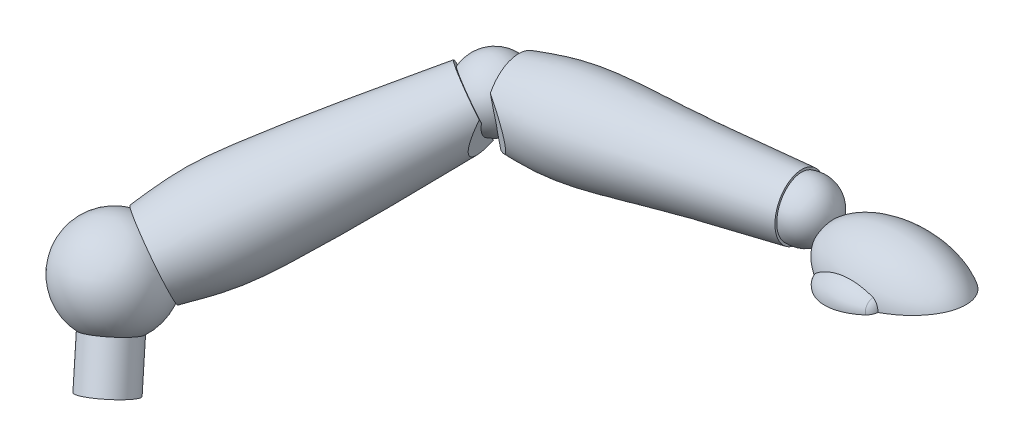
ISO-10303-21;
HEADER;
FILE_DESCRIPTION(('STEP AP214'),'2;1');
FILE_NAME('part.step','',(''),(''),'','','');
FILE_SCHEMA(('AUTOMOTIVE_DESIGN { 1 0 10303 214 1 1 1 1 }'));
ENDSEC;
DATA;
#1=APPLICATION_CONTEXT('core data for automotive mechanical design processes');
#2=APPLICATION_PROTOCOL_DEFINITION('international standard','automotive_design',2000,#1);
#3=PRODUCT_CONTEXT('',#1,'mechanical');
#4=PRODUCT('Part','Part','',(#3));
#5=PRODUCT_RELATED_PRODUCT_CATEGORY('part','',(#4));
#6=PRODUCT_DEFINITION_FORMATION('','',#4);
#7=PRODUCT_DEFINITION_CONTEXT('part definition',#1,'design');
#8=PRODUCT_DEFINITION('design','',#6,#7);
#9=PRODUCT_DEFINITION_SHAPE('','',#8);
#10=(LENGTH_UNIT() NAMED_UNIT(*) SI_UNIT(.MILLI.,.METRE.));
#11=(NAMED_UNIT(*) PLANE_ANGLE_UNIT() SI_UNIT($,.RADIAN.));
#12=(NAMED_UNIT(*) SI_UNIT($,.STERADIAN.) SOLID_ANGLE_UNIT());
#13=UNCERTAINTY_MEASURE_WITH_UNIT(LENGTH_MEASURE(1.E-05),#10,'distance_accuracy_value','');
#14=(GEOMETRIC_REPRESENTATION_CONTEXT(3) GLOBAL_UNCERTAINTY_ASSIGNED_CONTEXT((#13)) GLOBAL_UNIT_ASSIGNED_CONTEXT((#10,
#11,#12)) REPRESENTATION_CONTEXT('',''));
#15=CARTESIAN_POINT('',(0.,0.,0.));
#16=DIRECTION('',(0.,0.,1.));
#17=DIRECTION('',(1.,0.,0.));
#18=AXIS2_PLACEMENT_3D('',#15,#16,#17);
#19=CARTESIAN_POINT('',(195.802103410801,47.416164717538,-97.2586133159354));
#20=DIRECTION('',(-0.981506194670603,0.191430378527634,0.));
#21=DIRECTION('',(-0.191430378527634,-0.981506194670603,0.));
#22=AXIS2_PLACEMENT_3D('',#19,#20,#21);
#23=SPHERICAL_SURFACE('',#22,28.8036);
#24=CARTESIAN_POINT('',(215.014208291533,29.3446279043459,-108.832806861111));
#25=CARTESIAN_POINT('',(215.146566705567,29.6601097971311,-109.105687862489));
#26=CARTESIAN_POINT('',(215.283096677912,29.9865185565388,-109.363869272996));
#27=CARTESIAN_POINT('',(215.563386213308,30.6588836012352,-109.849253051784));
#28=CARTESIAN_POINT('',(215.707148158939,31.0048463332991,-110.076445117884));
#29=CARTESIAN_POINT('',(216.000859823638,31.7141341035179,-110.498552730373));
#30=CARTESIAN_POINT('',(216.15081759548,32.0774818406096,-110.693424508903));
#31=CARTESIAN_POINT('',(216.455540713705,32.8184756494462,-111.04928099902));
#32=CARTESIAN_POINT('',(216.610306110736,33.196121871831,-111.210265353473));
#33=CARTESIAN_POINT('',(216.923260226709,33.9625520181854,-111.497156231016));
#34=CARTESIAN_POINT('',(217.081444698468,34.3513222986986,-111.62310385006));
#35=CARTESIAN_POINT('',(217.400233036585,35.1376849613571,-111.839381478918));
#36=CARTESIAN_POINT('',(217.560836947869,35.5352775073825,-111.929710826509));
#37=CARTESIAN_POINT('',(217.883242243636,36.3363581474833,-112.074150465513));
#38=CARTESIAN_POINT('',(218.045043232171,36.739844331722,-112.128272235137));
#39=CARTESIAN_POINT('',(218.368745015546,37.5500091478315,-112.199985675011));
#40=CARTESIAN_POINT('',(218.530645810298,37.9566877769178,-112.21757737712));
#41=CARTESIAN_POINT('',(218.85438205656,38.772806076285,-112.216087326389));
#42=CARTESIAN_POINT('',(219.016211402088,39.1822477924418,-112.196787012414));
#43=CARTESIAN_POINT('',(219.337712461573,39.9985554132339,-112.12116402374));
#44=CARTESIAN_POINT('',(219.497384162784,40.4054213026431,-112.064841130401));
#45=CARTESIAN_POINT('',(219.813486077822,41.2136702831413,-111.915482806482));
#46=CARTESIAN_POINT('',(219.969916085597,41.6150530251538,-111.82244504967));
#47=CARTESIAN_POINT('',(220.278460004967,42.4093798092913,-111.600207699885));
#48=CARTESIAN_POINT('',(220.430573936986,42.8023238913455,-111.471008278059));
#49=CARTESIAN_POINT('',(220.72903153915,43.5757662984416,-111.177656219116));
#50=CARTESIAN_POINT('',(220.875390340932,43.9562967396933,-111.013603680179));
#51=CARTESIAN_POINT('',(221.161805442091,44.7032241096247,-110.6513585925));
#52=CARTESIAN_POINT('',(221.301861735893,45.0696210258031,-110.45316601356));
#53=CARTESIAN_POINT('',(221.574716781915,45.7854637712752,-110.023931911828));
#54=CARTESIAN_POINT('',(221.707515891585,46.134910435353,-109.792892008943));
#55=CARTESIAN_POINT('',(221.964958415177,46.8141451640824,-109.299490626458));
#56=CARTESIAN_POINT('',(222.089601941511,47.1439334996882,-109.037129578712));
#57=CARTESIAN_POINT('',(222.327998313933,47.7762432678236,-108.487211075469));
#58=CARTESIAN_POINT('',(222.441890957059,48.0791103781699,-108.200111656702));
#59=CARTESIAN_POINT('',(222.660179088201,48.6608692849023,-107.599243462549));
#60=CARTESIAN_POINT('',(222.764574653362,48.9397612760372,-107.285474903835));
#61=CARTESIAN_POINT('',(222.963149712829,49.471303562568,-106.633478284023));
#62=CARTESIAN_POINT('',(223.057330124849,49.7239562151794,-106.295252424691));
#63=CARTESIAN_POINT('',(223.23483684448,50.2009745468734,-105.596723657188));
#64=CARTESIAN_POINT('',(223.318163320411,50.4253406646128,-105.236421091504));
#65=CARTESIAN_POINT('',(223.471745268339,50.8394979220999,-104.504166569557));
#66=CARTESIAN_POINT('',(223.542239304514,51.0299183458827,-104.132620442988));
#67=CARTESIAN_POINT('',(223.671796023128,51.3803102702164,-103.373521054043));
#68=CARTESIAN_POINT('',(223.730858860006,51.540282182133,-102.985968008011));
#69=CARTESIAN_POINT('',(223.837146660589,51.8284450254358,-102.197684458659));
#70=CARTESIAN_POINT('',(223.884372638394,51.9566386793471,-101.796955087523));
#71=CARTESIAN_POINT('',(223.966668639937,52.1801910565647,-100.985220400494));
#72=CARTESIAN_POINT('',(224.00173879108,52.2755501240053,-100.574215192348));
#73=CARTESIAN_POINT('',(224.058966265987,52.4312299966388,-99.7523641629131));
#74=CARTESIAN_POINT('',(224.081342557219,52.4921448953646,-99.341646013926));
#75=CARTESIAN_POINT('',(224.113985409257,52.5810272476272,-98.5161853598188));
#76=CARTESIAN_POINT('',(224.124252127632,52.6089951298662,-98.1014429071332));
#77=CARTESIAN_POINT('',(224.132606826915,52.6317535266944,-97.2709488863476));
#78=CARTESIAN_POINT('',(224.130695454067,52.6265458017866,-96.855197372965));
#79=CARTESIAN_POINT('',(224.11470834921,52.5829999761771,-96.0256682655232));
#80=CARTESIAN_POINT('',(224.100632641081,52.5446619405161,-95.6118906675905));
#81=CARTESIAN_POINT('',(224.060569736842,52.4356013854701,-94.7925274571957));
#82=CARTESIAN_POINT('',(224.034676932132,52.3651354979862,-94.3869030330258));
#83=CARTESIAN_POINT('',(223.97118162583,52.1924705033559,-93.5834030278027));
#84=CARTESIAN_POINT('',(223.933579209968,52.0902716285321,-93.1855273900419));
#85=CARTESIAN_POINT('',(223.846911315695,51.8549574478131,-92.4003107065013));
#86=CARTESIAN_POINT('',(223.797845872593,51.7218422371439,-92.0129696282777));
#87=CARTESIAN_POINT('',(223.688571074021,51.4257477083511,-91.2515006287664));
#88=CARTESIAN_POINT('',(223.62836165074,51.2627682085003,-90.8773727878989));
#89=CARTESIAN_POINT('',(223.496877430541,50.9073805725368,-90.1431549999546));
#90=CARTESIAN_POINT('',(223.42555171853,50.7148370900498,-89.7831396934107));
#91=CARTESIAN_POINT('',(223.272503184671,50.3023855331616,-89.0814676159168));
#92=CARTESIAN_POINT('',(223.190780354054,50.0824774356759,-88.7398108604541));
#93=CARTESIAN_POINT('',(223.017455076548,49.6169676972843,-88.0771124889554));
#94=CARTESIAN_POINT('',(222.925852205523,49.3713649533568,-87.7560717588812));
#95=CARTESIAN_POINT('',(222.733347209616,48.8563173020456,-87.1367097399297));
#96=CARTESIAN_POINT('',(222.632444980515,48.5868721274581,-86.8383887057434));
#97=CARTESIAN_POINT('',(222.420345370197,48.0217950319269,-86.2619503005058));
#98=CARTESIAN_POINT('',(222.309013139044,47.7258231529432,-85.9842157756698));
#99=CARTESIAN_POINT('',(222.078117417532,47.1135471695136,-85.4559138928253));
#100=CARTESIAN_POINT('',(221.958553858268,46.7972428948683,-85.2053467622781));
#101=CARTESIAN_POINT('',(221.711939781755,46.1465869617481,-84.7329287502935));
#102=CARTESIAN_POINT('',(221.584888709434,45.8122339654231,-84.5110800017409));
#103=CARTESIAN_POINT('',(221.324101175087,45.1278927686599,-84.0974707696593));
#104=CARTESIAN_POINT('',(221.190364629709,44.7779043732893,-83.9057106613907));
#105=CARTESIAN_POINT('',(220.914212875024,44.0573801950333,-83.5497795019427));
#106=CARTESIAN_POINT('',(220.771675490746,43.6865693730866,-83.386259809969));
#107=CARTESIAN_POINT('',(220.481419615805,42.9338768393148,-83.0927365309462));
#108=CARTESIAN_POINT('',(220.333701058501,42.5519949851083,-82.9627333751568));
#109=CARTESIAN_POINT('',(220.034022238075,41.7798227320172,-82.7369949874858));
#110=CARTESIAN_POINT('',(219.882061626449,41.3895316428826,-82.6412625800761));
#111=CARTESIAN_POINT('',(219.574891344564,40.6032819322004,-82.4846216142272));
#112=CARTESIAN_POINT('',(219.419681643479,40.2073232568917,-82.4237133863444));
#113=CARTESIAN_POINT('',(219.104170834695,39.4052070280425,-82.3362600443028));
#114=CARTESIAN_POINT('',(218.943828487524,38.9989951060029,-82.3103613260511));
#115=CARTESIAN_POINT('',(218.621911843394,38.1863715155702,-82.2951346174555));
#116=CARTESIAN_POINT('',(218.460337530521,37.7799598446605,-82.3058071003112));
#117=CARTESIAN_POINT('',(218.137064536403,36.9697594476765,-82.3636282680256));
#118=CARTESIAN_POINT('',(217.975365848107,36.5659708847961,-82.4107792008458));
#119=CARTESIAN_POINT('',(217.652993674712,35.7638632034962,-82.5412453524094));
#120=CARTESIAN_POINT('',(217.492320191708,35.3655440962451,-82.6245606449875));
#121=CARTESIAN_POINT('',(217.171869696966,34.5739812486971,-82.8276411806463));
#122=CARTESIAN_POINT('',(217.012110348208,34.1808042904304,-82.9476947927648));
#123=CARTESIAN_POINT('',(216.696013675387,33.4056484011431,-83.2232472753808));
#124=CARTESIAN_POINT('',(216.539676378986,33.0236695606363,-83.3787464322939));
#125=CARTESIAN_POINT('',(216.231639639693,32.2736689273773,-83.7241970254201));
#126=CARTESIAN_POINT('',(216.079940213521,31.9056471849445,-83.9141485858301));
#127=CARTESIAN_POINT('',(215.782401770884,31.1862592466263,-84.3272794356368));
#128=CARTESIAN_POINT('',(215.636562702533,30.8348929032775,-84.5504584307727));
#129=CARTESIAN_POINT('',(215.352973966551,30.1538610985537,-85.0268865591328));
#130=CARTESIAN_POINT('',(215.215174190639,29.8240592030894,-85.2799108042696));
#131=CARTESIAN_POINT('',(214.947731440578,29.1859259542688,-85.8156188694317));
#132=CARTESIAN_POINT('',(214.818088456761,28.8775945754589,-86.0983026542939));
#133=CARTESIAN_POINT('',(214.568123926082,28.2847916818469,-86.6914085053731));
#134=CARTESIAN_POINT('',(214.447801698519,28.0003184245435,-87.0018285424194));
#135=CARTESIAN_POINT('',(214.217585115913,27.4574483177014,-87.6482834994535));
#136=CARTESIAN_POINT('',(214.107690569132,27.1990509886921,-87.9843179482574));
#137=CARTESIAN_POINT('',(213.901585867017,26.7155729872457,-88.6722854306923));
#138=CARTESIAN_POINT('',(213.805135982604,26.489904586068,-89.0237336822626));
#139=CARTESIAN_POINT('',(213.624167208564,26.0673431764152,-89.7464477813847));
#140=CARTESIAN_POINT('',(213.539648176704,25.8704498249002,-90.1177133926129));
#141=CARTESIAN_POINT('',(213.383388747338,25.5070622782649,-90.8773616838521));
#142=CARTESIAN_POINT('',(213.311646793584,25.34056438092,-91.2657422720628));
#143=CARTESIAN_POINT('',(213.181663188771,25.0393255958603,-92.0568160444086));
#144=CARTESIAN_POINT('',(213.123421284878,24.904584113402,-92.4595089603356));
#145=CARTESIAN_POINT('',(213.022370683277,24.6710564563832,-93.2656404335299));
#146=CARTESIAN_POINT('',(212.979202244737,24.5714315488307,-93.6687911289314));
#147=CARTESIAN_POINT('',(212.906694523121,24.40421654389,-94.4829031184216));
#148=CARTESIAN_POINT('',(212.877354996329,24.3366258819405,-94.8938642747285));
#149=CARTESIAN_POINT('',(212.832810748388,24.2340455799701,-95.7205352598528));
#150=CARTESIAN_POINT('',(212.817604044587,24.1990513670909,-96.1362444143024));
#151=CARTESIAN_POINT('',(212.801476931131,24.161939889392,-96.9694029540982));
#152=CARTESIAN_POINT('',(212.800556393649,24.1598223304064,-97.3868523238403));
#153=CARTESIAN_POINT('',(212.812904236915,24.1882357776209,-98.2132947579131));
#154=CARTESIAN_POINT('',(212.825931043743,24.2182109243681,-98.6223106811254));
#155=CARTESIAN_POINT('',(212.865664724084,24.3096992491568,-99.4361252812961));
#156=CARTESIAN_POINT('',(212.892371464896,24.3712121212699,-99.8409239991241));
#157=CARTESIAN_POINT('',(212.959206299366,24.5253016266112,-100.643539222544));
#158=CARTESIAN_POINT('',(212.999337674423,24.6178858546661,-101.041353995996));
#159=CARTESIAN_POINT('',(213.092623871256,24.8333785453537,-101.827112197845));
#160=CARTESIAN_POINT('',(213.145778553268,24.9562866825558,-102.215055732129));
#161=CARTESIAN_POINT('',(213.264705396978,25.2317170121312,-102.979096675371));
#162=CARTESIAN_POINT('',(213.330500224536,25.384292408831,-103.355171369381));
#163=CARTESIAN_POINT('',(213.47402265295,25.7177418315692,-104.092195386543));
#164=CARTESIAN_POINT('',(213.551750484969,25.8986164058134,-104.453144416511));
#165=CARTESIAN_POINT('',(213.718335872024,26.287097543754,-105.157150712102));
#166=CARTESIAN_POINT('',(213.807181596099,26.4946756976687,-105.500226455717));
#167=CARTESIAN_POINT('',(213.995244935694,26.9351135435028,-106.166578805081));
#168=CARTESIAN_POINT('',(214.094459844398,27.167966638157,-106.489860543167));
#169=CARTESIAN_POINT('',(214.321961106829,27.7032931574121,-107.173362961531));
#170=CARTESIAN_POINT('',(214.45220958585,28.0106325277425,-107.529136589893));
#171=CARTESIAN_POINT('',(214.724651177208,28.6556757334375,-108.206949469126));
#172=CARTESIAN_POINT('',(214.866844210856,28.9933793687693,-108.528988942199));
#173=CARTESIAN_POINT('',(215.014208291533,29.3446279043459,-108.832806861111));
#174=B_SPLINE_CURVE_WITH_KNOTS('',3,(#24,#25,#26,#27,#28,#29,#30,#31,#32,#33,#34,#35,#36,#37,
#38,#39,#40,#41,#42,#43,#44,#45,#46,#47,#48,#49,#50,#51,#52,#53,#54,#55,#56,#57,#58,#59,#60,#61,
#62,#63,#64,#65,#66,#67,#68,#69,#70,#71,#72,#73,#74,#75,#76,#77,#78,#79,#80,#81,#82,#83,#84,#85,
#86,#87,#88,#89,#90,#91,#92,#93,#94,#95,#96,#97,#98,#99,#100,#101,#102,#103,#104,#105,#106,#107,
#108,#109,#110,#111,#112,#113,#114,#115,#116,#117,#118,#119,#120,#121,#122,#123,#124,#125,#126,
#127,#128,#129,#130,#131,#132,#133,#134,#135,#136,#137,#138,#139,#140,#141,#142,#143,#144,#145,
#146,#147,#148,#149,#150,#151,#152,#153,#154,#155,#156,#157,#158,#159,#160,#161,#162,#163,#164,
#165,#166,#167,#168,#169,#170,#171,#172,#173),.UNSPECIFIED.,.T.,.F.,(4,2,2,2,2,2,2,2,2,2,2,2,2,
2,2,2,2,2,2,2,2,2,2,2,2,2,2,2,2,2,2,2,2,2,2,2,2,2,2,2,2,2,2,2,2,2,2,2,2,2,2,2,2,2,2,2,2,2,2,2,2,
2,2,2,2,2,2,2,2,2,2,2,2,2,4),(0.,1.31241787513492,2.62527099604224,3.93988770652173,
5.25451827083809,6.56760028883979,7.88070671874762,9.19339668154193,10.506085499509,
11.8265752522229,13.1470728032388,14.4676540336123,15.7882290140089,17.105061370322,
18.4218948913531,19.7386634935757,21.0554139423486,22.3515787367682,23.6477330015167,
24.9437707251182,26.2397883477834,27.50847847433,28.7771514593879,30.0457157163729,
31.314266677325,32.5602123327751,33.8061417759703,35.0520051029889,36.2978659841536,
37.5339449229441,38.7700148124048,40.0060808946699,41.2421544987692,42.4840656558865,
43.7259778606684,44.9679434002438,46.2099228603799,47.4710693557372,48.7322264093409,
49.9934770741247,51.2547434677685,52.5420505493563,53.8293741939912,55.1168039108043,
56.4042458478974,57.715147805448,59.0260667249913,60.337066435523,61.6480688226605,
62.9696376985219,64.2912172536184,65.6128015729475,66.9343741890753,68.2465580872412,
69.5587404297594,70.8708268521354,72.1828891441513,73.4672793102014,74.7516541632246,
76.0358724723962,77.3200667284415,78.5710944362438,79.8221000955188,81.0729302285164,
82.3237491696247,83.5532486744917,84.7827362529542,86.0125245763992,87.2422997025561,
88.4743009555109,89.7063260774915,90.9370511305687,92.1674557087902,93.628673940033,
95.0898825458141),.UNSPECIFIED.);
#175=CARTESIAN_POINT('',(215.014208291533,29.3446279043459,-108.832806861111));
#176=VERTEX_POINT('',#175);
#177=EDGE_CURVE('E166',#176,#176,#174,.T.);
#178=ORIENTED_EDGE('',*,*,#177,.F.);
#179=EDGE_LOOP('',(#178));
#180=FACE_BOUND('',#179,.T.);
#181=CARTESIAN_POINT('',(190.236114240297,47.1549958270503,-96.3939626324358));
#182=DIRECTION('',(-0.987087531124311,-0.046316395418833,0.153339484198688));
#183=DIRECTION('',(0.153504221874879,0.,0.988147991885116));
#184=AXIS2_PLACEMENT_3D('',#181,#182,#183);
#185=CIRCLE('',#184,28.2462618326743);
#186=CARTESIAN_POINT('',(194.572034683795,47.1549958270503,-68.4824757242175));
#187=VERTEX_POINT('',#186);
#188=EDGE_CURVE('E11',#187,#187,#185,.T.);
#189=ORIENTED_EDGE('',*,*,#188,.F.);
#190=EDGE_LOOP('',(#189));
#191=FACE_BOUND('',#190,.T.);
#192=ADVANCED_FACE('F34',(#180,#191),#23,.T.);
#193=CARTESIAN_POINT('',(288.458898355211,29.3446279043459,-97.2586133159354));
#194=DIRECTION('',(0.,1.,0.));
#195=DIRECTION('',(1.,0.,0.));
#196=AXIS2_PLACEMENT_3D('',#193,#194,#195);
#197=ELLIPSE('',#196,76.2,43.434);
#198=TRIMMED_CURVE('',#197,(PARAMETER_VALUE(0.)),(PARAMETER_VALUE(3.14159265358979)),.T.,.PARAMETER.);
#199=CARTESIAN_POINT('',(399.821714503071,29.3446279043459,-97.2586133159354));
#200=DIRECTION('',(1.,0.,0.));
#201=AXIS1_PLACEMENT('',#199,#200);
#202=SURFACE_OF_REVOLUTION('',#198,#201);
#203=CARTESIAN_POINT('',(236.919959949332,26.5332540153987,-65.3903069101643));
#204=CARTESIAN_POINT('',(237.386691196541,27.0082410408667,-65.1031511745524));
#205=CARTESIAN_POINT('',(237.863117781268,27.4814336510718,-64.8289140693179));
#206=CARTESIAN_POINT('',(238.834373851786,28.4218646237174,-64.305159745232));
#207=CARTESIAN_POINT('',(239.329191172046,28.8891066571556,-64.0556265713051));
#208=CARTESIAN_POINT('',(240.336742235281,29.8157952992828,-63.5798434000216));
#209=CARTESIAN_POINT('',(240.849472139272,30.2752435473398,-63.3535884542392));
#210=CARTESIAN_POINT('',(241.89165222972,31.1839396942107,-62.9231880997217));
#211=CARTESIAN_POINT('',(242.421080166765,31.633199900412,-62.7190147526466));
#212=CARTESIAN_POINT('',(243.496766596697,32.5204159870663,-62.3309803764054));
#213=CARTESIAN_POINT('',(244.043028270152,32.9583697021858,-62.1471232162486));
#214=CARTESIAN_POINT('',(245.151756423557,33.8212917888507,-61.7982742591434));
#215=CARTESIAN_POINT('',(245.714226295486,34.2462574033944,-61.6332864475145));
#216=CARTESIAN_POINT('',(247.162972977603,35.3073961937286,-61.2362442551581));
#217=CARTESIAN_POINT('',(248.059922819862,35.9335560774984,-61.0161495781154));
#218=CARTESIAN_POINT('',(249.88835952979,37.146176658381,-60.6119327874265));
#219=CARTESIAN_POINT('',(250.819855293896,37.7326270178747,-60.4278200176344));
#220=CARTESIAN_POINT('',(252.714779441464,38.8612999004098,-60.0903732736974));
#221=CARTESIAN_POINT('',(253.678210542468,39.4035186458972,-59.9370419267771));
#222=CARTESIAN_POINT('',(255.635347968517,40.440390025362,-59.6560304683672));
#223=CARTESIAN_POINT('',(256.629086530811,40.9349895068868,-59.5283788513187));
#224=CARTESIAN_POINT('',(258.642925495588,41.8726058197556,-59.2942690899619));
#225=CARTESIAN_POINT('',(259.663023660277,42.3156270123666,-59.1878091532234));
#226=CARTESIAN_POINT('',(261.726734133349,43.1473600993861,-58.9917985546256));
#227=CARTESIAN_POINT('',(262.770346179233,43.5360725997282,-58.9022477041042));
#228=CARTESIAN_POINT('',(264.623801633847,44.1699760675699,-58.7562967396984));
#229=CARTESIAN_POINT('',(265.429344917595,44.4271749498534,-58.6971094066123));
#230=CARTESIAN_POINT('',(267.050810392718,44.908173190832,-58.5848589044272));
#231=CARTESIAN_POINT('',(267.866732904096,45.1319715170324,-58.5317959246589));
#232=CARTESIAN_POINT('',(269.507476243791,45.5454703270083,-58.4305419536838));
#233=CARTESIAN_POINT('',(270.332297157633,45.7351704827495,-58.3823510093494));
#234=CARTESIAN_POINT('',(271.989359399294,46.079931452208,-58.2897907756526));
#235=CARTESIAN_POINT('',(272.821600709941,46.2349923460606,-58.2454214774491));
#236=CARTESIAN_POINT('',(274.492270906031,46.5101111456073,-58.1596500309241));
#237=CARTESIAN_POINT('',(275.330701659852,46.6301579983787,-58.1182488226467));
#238=CARTESIAN_POINT('',(277.011985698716,46.8349055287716,-58.0378023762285));
#239=CARTESIAN_POINT('',(277.854839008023,46.9196060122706,-57.9987571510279));
#240=CARTESIAN_POINT('',(279.543444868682,47.0535048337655,-57.9226146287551));
#241=CARTESIAN_POINT('',(280.38919741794,47.1027031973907,-57.8855173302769));
#242=CARTESIAN_POINT('',(282.082094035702,47.16555917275,-57.8130782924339));
#243=CARTESIAN_POINT('',(282.929238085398,47.1792172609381,-57.7777365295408));
#244=CARTESIAN_POINT('',(284.484883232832,47.1717366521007,-57.7144682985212));
#245=CARTESIAN_POINT('',(285.193404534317,47.1559225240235,-57.6862742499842));
#246=CARTESIAN_POINT('',(286.609542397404,47.099581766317,-57.6312588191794));
#247=CARTESIAN_POINT('',(287.317158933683,47.059054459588,-57.6044374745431));
#248=CARTESIAN_POINT('',(288.730646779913,46.9534328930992,-57.5523908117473));
#249=CARTESIAN_POINT('',(289.436518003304,46.888337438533,-57.5271655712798));
#250=CARTESIAN_POINT('',(290.845693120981,46.7337713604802,-57.4786306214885));
#251=CARTESIAN_POINT('',(291.548996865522,46.6442993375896,-57.4553210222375));
#252=CARTESIAN_POINT('',(292.952219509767,46.4412167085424,-57.4110281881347));
#253=CARTESIAN_POINT('',(293.652138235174,46.3276048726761,-57.3900450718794));
#254=CARTESIAN_POINT('',(295.048121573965,46.0764626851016,-57.3508932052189));
#255=CARTESIAN_POINT('',(295.744184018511,45.9389200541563,-57.3327259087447));
#256=CARTESIAN_POINT('',(297.131306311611,45.6402802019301,-57.2997972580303));
#257=CARTESIAN_POINT('',(297.822366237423,45.4791833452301,-57.2850358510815));
#258=CARTESIAN_POINT('',(299.198703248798,45.1338006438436,-57.2595741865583));
#259=CARTESIAN_POINT('',(299.883980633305,44.9495160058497,-57.2488737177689));
#260=CARTESIAN_POINT('',(301.247983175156,44.5581597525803,-57.2322539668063));
#261=CARTESIAN_POINT('',(301.926708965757,44.3510903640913,-57.2263342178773));
#262=CARTESIAN_POINT('',(303.276850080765,43.9146034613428,-57.2200716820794));
#263=CARTESIAN_POINT('',(303.948266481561,43.6851892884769,-57.2197280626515));
#264=CARTESIAN_POINT('',(304.615716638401,43.4447984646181,-57.2225702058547));
#265=B_SPLINE_CURVE_WITH_KNOTS('',3,(#203,#204,#205,#206,#207,#208,#209,#210,#211,#212,#213,
#214,#215,#216,#217,#218,#219,#220,#221,#222,#223,#224,#225,#226,#227,#228,#229,#230,#231,#232,
#233,#234,#235,#236,#237,#238,#239,#240,#241,#242,#243,#244,#245,#246,#247,#248,#249,#250,#251,
#252,#253,#254,#255,#256,#257,#258,#259,#260,#261,#262,#263,#264),.UNSPECIFIED.,.F.,.F.,(4,2,2,
2,2,2,2,2,2,2,2,2,2,2,2,2,2,2,2,2,2,2,2,2,2,2,2,2,2,2,4),(0.,2.17533273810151,4.34925124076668,
6.52270665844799,8.69337916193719,10.864464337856,13.0360072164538,16.3814563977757,
19.7277731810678,23.0743754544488,26.4246709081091,29.7746828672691,33.1246574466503,
35.6669854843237,38.2093920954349,40.7518231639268,43.2942483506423,45.8374752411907,
48.3807160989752,50.9239551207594,53.4671600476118,55.5945169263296,57.7219320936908,
59.849450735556,61.9770915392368,64.104840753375,66.2336849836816,68.362496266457,
70.491196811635,72.6196895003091,74.7478643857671),.UNSPECIFIED.);
#266=CARTESIAN_POINT('',(236.919959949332,26.5332540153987,-65.3903069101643));
#267=VERTEX_POINT('',#266);
#268=CARTESIAN_POINT('',(304.615716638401,43.4447984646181,-57.2225702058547));
#269=VERTEX_POINT('',#268);
#270=EDGE_CURVE('E176',#267,#269,#265,.T.);
#271=ORIENTED_EDGE('',*,*,#270,.T.);
#272=CARTESIAN_POINT('',(304.615716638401,43.4447984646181,-57.2225702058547));
#273=CARTESIAN_POINT('',(304.865805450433,43.3150558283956,-57.2096687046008));
#274=CARTESIAN_POINT('',(305.11073627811,43.1756958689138,-57.1940985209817));
#275=CARTESIAN_POINT('',(305.588898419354,42.8788363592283,-57.1582286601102));
#276=CARTESIAN_POINT('',(305.822132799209,42.7213415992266,-57.1379302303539));
#277=CARTESIAN_POINT('',(306.275479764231,42.3893639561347,-57.0932212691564));
#278=CARTESIAN_POINT('',(306.495602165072,42.2148940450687,-57.0688138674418));
#279=CARTESIAN_POINT('',(306.921796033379,41.8500249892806,-57.01653745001));
#280=CARTESIAN_POINT('',(307.127866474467,41.6596246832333,-56.9886681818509));
#281=CARTESIAN_POINT('',(307.542677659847,41.2464802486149,-56.9275419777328));
#282=CARTESIAN_POINT('',(307.750017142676,41.0223659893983,-56.8940262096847));
#283=CARTESIAN_POINT('',(308.145806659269,40.5583625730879,-56.8246009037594));
#284=CARTESIAN_POINT('',(308.334254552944,40.3184716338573,-56.7886910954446));
#285=CARTESIAN_POINT('',(308.691151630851,39.8251055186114,-56.7154454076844));
#286=CARTESIAN_POINT('',(308.85963450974,39.5716543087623,-56.6781120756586));
#287=CARTESIAN_POINT('',(309.17649166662,39.052627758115,-56.6028529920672));
#288=CARTESIAN_POINT('',(309.324868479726,38.7870539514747,-56.5649273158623));
#289=CARTESIAN_POINT('',(309.596724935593,38.2549639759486,-56.4906615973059));
#290=CARTESIAN_POINT('',(309.720887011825,37.9887965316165,-56.4543119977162));
#291=CARTESIAN_POINT('',(309.951045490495,37.4484358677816,-56.3826553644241));
#292=CARTESIAN_POINT('',(310.057031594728,37.1742382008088,-56.3473489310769));
#293=CARTESIAN_POINT('',(310.252158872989,36.6196503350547,-56.2786478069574));
#294=CARTESIAN_POINT('',(310.341295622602,36.3392585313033,-56.2452536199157));
#295=CARTESIAN_POINT('',(310.505976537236,35.7722084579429,-56.1811572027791));
#296=CARTESIAN_POINT('',(310.581425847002,35.4855208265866,-56.1504744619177));
#297=CARTESIAN_POINT('',(310.686996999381,35.0533920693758,-56.1074962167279));
#298=CARTESIAN_POINT('',(310.720919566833,34.9090028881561,-56.0936780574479));
#299=CARTESIAN_POINT('',(310.786759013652,34.6196615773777,-56.0671780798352));
#300=CARTESIAN_POINT('',(310.818675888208,34.4747094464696,-56.0544962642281));
#301=CARTESIAN_POINT('',(310.880859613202,34.1842956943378,-56.0303476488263));
#302=CARTESIAN_POINT('',(310.911125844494,34.0388339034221,-56.0188813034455));
#303=CARTESIAN_POINT('',(310.970054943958,33.7474934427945,-55.9971910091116));
#304=CARTESIAN_POINT('',(310.99871781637,33.6016147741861,-55.9869670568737));
#305=CARTESIAN_POINT('',(311.052446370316,33.3185620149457,-55.9683229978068));
#306=CARTESIAN_POINT('',(311.077624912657,33.181414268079,-55.9598300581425));
#307=CARTESIAN_POINT('',(311.125953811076,32.9067047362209,-55.943834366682));
#308=CARTESIAN_POINT('',(311.149104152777,32.7691429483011,-55.9363316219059));
#309=CARTESIAN_POINT('',(311.214771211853,32.3559510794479,-55.9151971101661));
#310=CARTESIAN_POINT('',(311.253539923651,32.0796315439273,-55.9029272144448));
#311=CARTESIAN_POINT('',(311.317580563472,31.52534259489,-55.8814757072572));
#312=CARTESIAN_POINT('',(311.342855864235,31.2473736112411,-55.8722933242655));
#313=CARTESIAN_POINT('',(311.377387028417,30.6924559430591,-55.8567266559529));
#314=CARTESIAN_POINT('',(311.386763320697,30.4155155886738,-55.8503216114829));
#315=CARTESIAN_POINT('',(311.388432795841,29.8613741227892,-55.8399994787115));
#316=CARTESIAN_POINT('',(311.380717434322,29.5841729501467,-55.8360836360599));
#317=CARTESIAN_POINT('',(311.347355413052,29.0308741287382,-55.8305858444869));
#318=CARTESIAN_POINT('',(311.321711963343,28.754776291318,-55.829003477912));
#319=CARTESIAN_POINT('',(311.245092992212,28.1500491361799,-55.8279116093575));
#320=CARTESIAN_POINT('',(311.190086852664,27.8219189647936,-55.8288781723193));
#321=CARTESIAN_POINT('',(311.053357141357,27.1713412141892,-55.8335970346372));
#322=CARTESIAN_POINT('',(310.971637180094,26.8488928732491,-55.8373489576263));
#323=CARTESIAN_POINT('',(310.781286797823,26.2109882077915,-55.8472193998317));
#324=CARTESIAN_POINT('',(310.672575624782,25.8955560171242,-55.853345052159));
#325=CARTESIAN_POINT('',(310.428822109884,25.2751941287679,-55.8674156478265));
#326=CARTESIAN_POINT('',(310.29378653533,24.9702617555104,-55.8753601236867));
#327=CARTESIAN_POINT('',(309.976191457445,24.3291536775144,-55.8936850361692));
#328=CARTESIAN_POINT('',(309.789563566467,23.9949771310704,-55.9042518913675));
#329=CARTESIAN_POINT('',(309.485792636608,23.509761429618,-55.9203985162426));
#330=CARTESIAN_POINT('',(309.380792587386,23.3509926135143,-55.9258192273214));
#331=CARTESIAN_POINT('',(309.162963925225,23.0389167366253,-55.9366156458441));
#332=CARTESIAN_POINT('',(309.050135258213,22.8856097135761,-55.9419913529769));
#333=CARTESIAN_POINT('',(308.93348461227,22.7352156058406,-55.9472695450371));
#334=B_SPLINE_CURVE_WITH_KNOTS('',3,(#272,#273,#274,#275,#276,#277,#278,#279,#280,#281,#282,
#283,#284,#285,#286,#287,#288,#289,#290,#291,#292,#293,#294,#295,#296,#297,#298,#299,#300,#301,
#302,#303,#304,#305,#306,#307,#308,#309,#310,#311,#312,#313,#314,#315,#316,#317,#318,#319,#320,
#321,#322,#323,#324,#325,#326,#327,#328,#329,#330,#331,#332,#333),.UNSPECIFIED.,.F.,.F.,(4,2,2,
2,2,2,2,2,2,2,2,2,2,2,2,2,2,2,2,2,2,2,2,2,2,2,2,2,2,2,4),(0.,0.845844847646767,1.6914667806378,
2.53644750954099,3.38148989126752,4.30190569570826,5.22242564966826,6.14136923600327,
7.06019684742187,7.94731947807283,8.83494308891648,9.72279945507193,10.6165914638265,
11.0634672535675,11.5103441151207,11.95738746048,12.4044296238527,12.8235062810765,
13.2425859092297,14.0801850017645,14.9175746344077,15.7485925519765,16.5800260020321,
17.4113106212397,18.4082981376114,19.4051509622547,20.4050228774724,21.4046380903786,
22.5512419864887,23.1223148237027,23.6933916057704),.UNSPECIFIED.);
#335=CARTESIAN_POINT('',(310.952217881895,33.835456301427,-56.0037730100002));
#336=VERTEX_POINT('',#335);
#337=EDGE_CURVE('E204',#269,#336,#334,.T.);
#338=ORIENTED_EDGE('',*,*,#337,.T.);
#339=CARTESIAN_POINT('',(290.422716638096,29.3446279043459,-140.678186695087));
#340=CARTESIAN_POINT('',(292.051299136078,29.7008803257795,-140.654254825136));
#341=CARTESIAN_POINT('',(293.679401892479,30.0570278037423,-140.596177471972));
#342=CARTESIAN_POINT('',(296.932387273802,30.7686183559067,-140.411269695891));
#343=CARTESIAN_POINT('',(298.557268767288,31.1240611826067,-140.2844183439));
#344=CARTESIAN_POINT('',(301.800933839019,31.8336129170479,-139.960941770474));
#345=CARTESIAN_POINT('',(303.41971530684,32.1877213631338,-139.76429430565));
#346=CARTESIAN_POINT('',(306.648253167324,32.8939640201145,-139.29962148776));
#347=CARTESIAN_POINT('',(308.258005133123,33.2460972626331,-139.031563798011));
#348=CARTESIAN_POINT('',(311.461769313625,33.946920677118,-138.422479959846));
#349=CARTESIAN_POINT('',(313.055801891,34.2956153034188,-138.081566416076));
#350=CARTESIAN_POINT('',(316.226367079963,34.9891764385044,-137.323850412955));
#351=CARTESIAN_POINT('',(317.802902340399,35.3340435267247,-136.907059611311));
#352=CARTESIAN_POINT('',(320.932959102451,36.0187434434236,-135.994398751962));
#353=CARTESIAN_POINT('',(322.486494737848,36.3585793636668,-135.498579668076));
#354=CARTESIAN_POINT('',(325.56484523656,37.03196853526,-134.423776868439));
#355=CARTESIAN_POINT('',(327.089678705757,37.3655258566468,-133.844849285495));
#356=CARTESIAN_POINT('',(329.950085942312,37.9912399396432,-132.662316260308));
#357=CARTESIAN_POINT('',(331.289047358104,38.2841377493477,-132.067312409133));
#358=CARTESIAN_POINT('',(333.932425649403,38.8623767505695,-130.801640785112));
#359=CARTESIAN_POINT('',(335.236845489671,39.147718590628,-130.130979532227));
#360=CARTESIAN_POINT('',(337.80259020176,39.7089752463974,-128.709281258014));
#361=CARTESIAN_POINT('',(339.063934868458,39.9848943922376,-127.958281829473));
#362=CARTESIAN_POINT('',(341.533873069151,40.5251933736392,-126.37009455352));
#363=CARTESIAN_POINT('',(342.742473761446,40.7895747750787,-125.532918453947));
#364=CARTESIAN_POINT('',(344.894536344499,41.2603384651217,-123.916088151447));
#365=CARTESIAN_POINT('',(345.848224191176,41.4689576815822,-123.150723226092));
#366=CARTESIAN_POINT('',(347.700744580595,41.8741965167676,-121.552907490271));
#367=CARTESIAN_POINT('',(348.599573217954,42.0708152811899,-120.720451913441));
#368=CARTESIAN_POINT('',(350.329434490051,42.449222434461,-118.986593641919));
#369=CARTESIAN_POINT('',(351.160565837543,42.631032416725,-118.085295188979));
#370=CARTESIAN_POINT('',(352.346255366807,42.8904020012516,-116.680039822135));
#371=CARTESIAN_POINT('',(352.731267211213,42.9746233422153,-116.202807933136));
#372=CARTESIAN_POINT('',(353.479135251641,43.138219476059,-115.23027083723));
#373=CARTESIAN_POINT('',(353.841986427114,43.2175931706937,-114.73496157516));
#374=CARTESIAN_POINT('',(354.674863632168,43.3997850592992,-113.537152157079));
#375=CARTESIAN_POINT('',(355.134007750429,43.5002228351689,-112.826654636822));
#376=CARTESIAN_POINT('',(355.999679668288,43.6895885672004,-111.373057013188));
#377=CARTESIAN_POINT('',(356.40622299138,43.7785199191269,-110.629966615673));
#378=CARTESIAN_POINT('',(357.16015951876,43.9434435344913,-109.113177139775));
#379=CARTESIAN_POINT('',(357.507583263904,44.0194424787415,-108.339494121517));
#380=CARTESIAN_POINT('',(357.979490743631,44.1226722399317,-107.158505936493));
#381=CARTESIAN_POINT('',(358.128605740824,44.1552911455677,-106.761376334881));
#382=CARTESIAN_POINT('',(358.409661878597,44.2167721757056,-105.960796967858));
#383=CARTESIAN_POINT('',(358.541603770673,44.2456344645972,-105.557347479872));
#384=CARTESIAN_POINT('',(358.830140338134,44.3087518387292,-104.604059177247));
#385=CARTESIAN_POINT('',(358.979457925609,44.3414150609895,-104.05189172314));
#386=CARTESIAN_POINT('',(359.243949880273,44.3992726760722,-102.939026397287));
#387=CARTESIAN_POINT('',(359.359122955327,44.4244667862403,-102.378328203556));
#388=CARTESIAN_POINT('',(359.553967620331,44.4670890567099,-101.250491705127));
#389=CARTESIAN_POINT('',(359.633639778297,44.4845173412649,-100.683353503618));
#390=CARTESIAN_POINT('',(359.756460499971,44.5113843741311,-99.5452964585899));
#391=CARTESIAN_POINT('',(359.799631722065,44.5208280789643,-98.9743801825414));
#392=CARTESIAN_POINT('',(359.848982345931,44.5316235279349,-97.8308479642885));
#393=CARTESIAN_POINT('',(359.855160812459,44.5329750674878,-97.2582319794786));
#394=CARTESIAN_POINT('',(359.830455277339,44.5275707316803,-96.1139610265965));
#395=CARTESIAN_POINT('',(359.799577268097,44.5208161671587,-95.5423059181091));
#396=CARTESIAN_POINT('',(359.686271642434,44.4960305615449,-94.2301729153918));
#397=CARTESIAN_POINT('',(359.591098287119,44.4752113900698,-93.4908153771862));
#398=CARTESIAN_POINT('',(359.340580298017,44.4204105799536,-92.0230617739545));
#399=CARTESIAN_POINT('',(359.185243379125,44.3864306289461,-91.2946643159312));
#400=CARTESIAN_POINT('',(358.81741234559,44.3059675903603,-89.8529439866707));
#401=CARTESIAN_POINT('',(358.604899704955,44.2594804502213,-89.1396260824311));
#402=CARTESIAN_POINT('',(358.126575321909,44.1548469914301,-87.7319688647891));
#403=CARTESIAN_POINT('',(357.860755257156,44.0966988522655,-87.0376325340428));
#404=CARTESIAN_POINT('',(357.190677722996,43.9501193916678,-85.4603951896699));
#405=CARTESIAN_POINT('',(356.768992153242,43.8578756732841,-84.5852257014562));
#406=CARTESIAN_POINT('',(355.851687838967,43.6572153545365,-82.876528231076));
#407=CARTESIAN_POINT('',(355.356049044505,43.5487943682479,-82.0430116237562));
#408=CARTESIAN_POINT('',(354.299750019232,43.3177289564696,-80.418710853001));
#409=CARTESIAN_POINT('',(353.738992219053,43.1950631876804,-79.6279934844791));
#410=CARTESIAN_POINT('',(352.56191643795,42.9375778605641,-78.0913066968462));
#411=CARTESIAN_POINT('',(351.945595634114,42.8027576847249,-77.3453395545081));
#412=CARTESIAN_POINT('',(350.673025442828,42.5243829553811,-75.9065738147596));
#413=CARTESIAN_POINT('',(350.017350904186,42.3809541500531,-75.2132401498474));
#414=CARTESIAN_POINT('',(348.665707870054,42.0852822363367,-73.8685797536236));
#415=CARTESIAN_POINT('',(347.969722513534,41.933035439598,-73.2172708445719));
#416=CARTESIAN_POINT('',(346.543220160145,41.6209880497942,-71.9555067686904));
#417=CARTESIAN_POINT('',(345.812698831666,41.4611865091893,-71.3450567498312));
#418=CARTESIAN_POINT('',(344.320780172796,41.1348293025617,-70.1625853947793));
#419=CARTESIAN_POINT('',(343.559335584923,40.9682632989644,-69.5906267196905));
#420=CARTESIAN_POINT('',(342.010855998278,40.6295333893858,-68.4846627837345));
#421=CARTESIAN_POINT('',(341.223825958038,40.4573705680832,-67.9506502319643));
#422=CARTESIAN_POINT('',(339.627429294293,40.108158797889,-66.9188181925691));
#423=CARTESIAN_POINT('',(338.818060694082,39.9311094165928,-66.421001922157));
#424=CARTESIAN_POINT('',(336.673333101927,39.4619502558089,-65.1628238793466));
#425=CARTESIAN_POINT('',(335.322219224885,39.1663940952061,-64.4304781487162));
#426=CARTESIAN_POINT('',(332.578876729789,38.5662879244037,-63.0502815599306));
#427=CARTESIAN_POINT('',(331.186627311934,38.261733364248,-62.4024743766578));
#428=CARTESIAN_POINT('',(328.369195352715,37.6454201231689,-61.1863570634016));
#429=CARTESIAN_POINT('',(326.944007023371,37.3336601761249,-60.6180610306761));
#430=CARTESIAN_POINT('',(324.064798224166,36.7038332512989,-59.555707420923));
#431=CARTESIAN_POINT('',(322.610732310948,36.3857563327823,-59.0617794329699));
#432=CARTESIAN_POINT('',(319.681664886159,35.7450228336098,-58.1456497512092));
#433=CARTESIAN_POINT('',(318.206668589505,35.4223673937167,-57.7234305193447));
#434=CARTESIAN_POINT('',(315.23951478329,34.7733024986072,-56.9473973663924));
#435=CARTESIAN_POINT('',(313.747356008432,34.4468927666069,-56.593588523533));
#436=CARTESIAN_POINT('',(311.187707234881,33.8869695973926,-56.0456608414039));
#437=CARTESIAN_POINT('',(310.123542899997,33.6541836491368,-55.8350903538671));
#438=CARTESIAN_POINT('',(307.989588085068,33.187381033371,-55.4462309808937));
#439=CARTESIAN_POINT('',(306.919797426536,32.9533643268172,-55.2679431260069));
#440=CARTESIAN_POINT('',(303.702925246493,32.2496735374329,-54.7804576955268));
#441=CARTESIAN_POINT('',(301.548812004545,31.7784612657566,-54.5187377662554));
#442=CARTESIAN_POINT('',(297.229392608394,30.8335882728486,-54.118347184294));
#443=CARTESIAN_POINT('',(295.064083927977,30.3599269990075,-53.9797056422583));
#444=CARTESIAN_POINT('',(290.728364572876,29.411488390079,-53.8236846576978));
#445=CARTESIAN_POINT('',(288.557952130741,28.9367106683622,-53.8063564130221));
#446=CARTESIAN_POINT('',(284.21998762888,27.9877809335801,-53.8928607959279));
#447=CARTESIAN_POINT('',(282.052434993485,27.5136287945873,-53.9966633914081));
#448=CARTESIAN_POINT('',(277.7266764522,26.5673691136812,-54.3267175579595));
#449=CARTESIAN_POINT('',(275.568468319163,26.0952610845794,-54.5529381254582));
#450=CARTESIAN_POINT('',(271.764484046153,25.2631395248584,-55.0641620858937));
#451=CARTESIAN_POINT('',(270.115389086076,24.9024000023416,-55.3235527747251));
#452=CARTESIAN_POINT('',(266.830415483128,24.1838120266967,-55.918715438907));
#453=CARTESIAN_POINT('',(265.194536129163,23.825963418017,-56.254483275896));
#454=CARTESIAN_POINT('',(261.939777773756,23.1139850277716,-57.0052968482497));
#455=CARTESIAN_POINT('',(260.320902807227,22.7598561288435,-57.4203609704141));
#456=CARTESIAN_POINT('',(257.109346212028,22.0573281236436,-58.3322211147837));
#457=CARTESIAN_POINT('',(255.516611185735,21.708917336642,-58.8288192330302));
#458=CARTESIAN_POINT('',(252.359662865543,21.0183348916,-59.9087749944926));
#459=CARTESIAN_POINT('',(250.795444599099,20.6761621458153,-60.4921173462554));
#460=CARTESIAN_POINT('',(247.703406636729,19.999778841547,-61.7507204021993));
#461=CARTESIAN_POINT('',(246.175568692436,19.6655642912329,-62.4259338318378));
#462=CARTESIAN_POINT('',(243.380415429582,19.0541245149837,-63.7712439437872));
#463=CARTESIAN_POINT('',(242.107097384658,18.7755861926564,-64.4282550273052));
#464=CARTESIAN_POINT('',(239.601128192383,18.2274054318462,-65.8193709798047));
#465=CARTESIAN_POINT('',(238.368475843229,17.9577627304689,-66.5534735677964));
#466=CARTESIAN_POINT('',(235.953965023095,17.4295884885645,-68.1036164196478));
#467=CARTESIAN_POINT('',(234.772082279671,17.1710516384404,-68.9196168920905));
#468=CARTESIAN_POINT('',(232.470797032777,16.6676454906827,-70.6393430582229));
#469=CARTESIAN_POINT('',(231.351378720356,16.422772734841,-71.5430463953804));
#470=CARTESIAN_POINT('',(229.45789289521,16.0085727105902,-73.2085779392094));
#471=CARTESIAN_POINT('',(228.666881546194,15.8355389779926,-73.9502226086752));
#472=CARTESIAN_POINT('',(227.137309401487,15.5009450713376,-75.4884296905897));
#473=CARTESIAN_POINT('',(226.39874903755,15.3393849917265,-76.2849925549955));
#474=CARTESIAN_POINT('',(224.984791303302,15.0300817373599,-77.9334901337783));
#475=CARTESIAN_POINT('',(224.30931254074,14.8823207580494,-78.7853510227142));
#476=CARTESIAN_POINT('',(223.351688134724,14.6728404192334,-80.1049556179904));
#477=CARTESIAN_POINT('',(223.041771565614,14.6050461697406,-80.5517496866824));
#478=CARTESIAN_POINT('',(222.441884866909,14.4738209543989,-81.4593467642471));
#479=CARTESIAN_POINT('',(222.151919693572,14.4103910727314,-81.9201532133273));
#480=CARTESIAN_POINT('',(221.455154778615,14.2579737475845,-83.087492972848));
#481=CARTESIAN_POINT('',(221.061777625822,14.171922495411,-83.8024959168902));
#482=CARTESIAN_POINT('',(220.329570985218,14.011752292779,-85.2611494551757));
#483=CARTESIAN_POINT('',(219.990726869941,13.9376301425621,-86.0047923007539));
#484=CARTESIAN_POINT('',(219.527869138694,13.8363800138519,-87.1392985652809));
#485=CARTESIAN_POINT('',(219.381169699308,13.8042895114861,-87.5205830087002));
#486=CARTESIAN_POINT('',(219.103563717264,13.743563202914,-88.2891029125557));
#487=CARTESIAN_POINT('',(218.972655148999,13.714926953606,-88.6763376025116));
#488=CARTESIAN_POINT('',(218.727287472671,13.6612527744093,-89.4562831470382));
#489=CARTESIAN_POINT('',(218.612830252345,13.6362152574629,-89.848994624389));
#490=CARTESIAN_POINT('',(218.401015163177,13.5898807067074,-90.6391998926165));
#491=CARTESIAN_POINT('',(218.303656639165,13.5685835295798,-91.0366934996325));
#492=CARTESIAN_POINT('',(218.096199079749,13.5232021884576,-91.9730083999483));
#493=CARTESIAN_POINT('',(217.993201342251,13.5006714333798,-92.5134986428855));
#494=CARTESIAN_POINT('',(217.820220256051,13.4628318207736,-93.6000041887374));
#495=CARTESIAN_POINT('',(217.750238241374,13.4475232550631,-94.1460197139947));
#496=CARTESIAN_POINT('',(217.644094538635,13.424304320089,-95.2414847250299));
#497=CARTESIAN_POINT('',(217.607931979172,13.4163937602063,-95.7909341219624));
#498=CARTESIAN_POINT('',(217.569857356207,13.4080649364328,-96.8909444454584));
#499=CARTESIAN_POINT('',(217.567937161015,13.4076448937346,-97.4415050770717));
#500=CARTESIAN_POINT('',(217.598352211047,13.4142981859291,-98.5416536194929));
#501=CARTESIAN_POINT('',(217.630688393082,13.4213717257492,-99.0912415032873));
#502=CARTESIAN_POINT('',(217.729218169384,13.4429251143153,-100.187128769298));
#503=CARTESIAN_POINT('',(217.795407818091,13.4574040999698,-100.733428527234));
#504=CARTESIAN_POINT('',(217.988820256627,13.4997130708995,-102.004140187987));
#505=CARTESIAN_POINT('',(218.129096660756,13.5303985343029,-102.726503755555));
#506=CARTESIAN_POINT('',(218.466106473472,13.6041194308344,-104.157094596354));
#507=CARTESIAN_POINT('',(218.662833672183,13.6471535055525,-104.865323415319));
#508=CARTESIAN_POINT('',(219.109265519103,13.7448104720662,-106.264230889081));
#509=CARTESIAN_POINT('',(219.358984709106,13.7994365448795,-106.954904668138));
#510=CARTESIAN_POINT('',(219.907324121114,13.9193857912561,-108.315599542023));
#511=CARTESIAN_POINT('',(220.205952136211,13.9847106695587,-108.985617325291));
#512=CARTESIAN_POINT('',(220.975189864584,14.1529814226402,-110.564089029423));
#513=CARTESIAN_POINT('',(221.46704145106,14.2605739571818,-111.461743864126));
#514=CARTESIAN_POINT('',(222.526329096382,14.492293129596,-113.209014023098));
#515=CARTESIAN_POINT('',(223.093791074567,14.6164254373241,-114.058612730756));
#516=CARTESIAN_POINT('',(224.294480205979,14.8790761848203,-115.709643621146));
#517=CARTESIAN_POINT('',(224.927817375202,15.0176186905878,-116.510991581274));
#518=CARTESIAN_POINT('',(226.24987085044,15.3068178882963,-118.064076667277));
#519=CARTESIAN_POINT('',(226.938588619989,15.4574749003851,-118.815812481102));
#520=CARTESIAN_POINT('',(228.369277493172,15.7704380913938,-120.277036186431));
#521=CARTESIAN_POINT('',(229.111656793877,15.9328335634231,-120.986103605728));
#522=CARTESIAN_POINT('',(230.63748930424,16.2666094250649,-122.356853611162));
#523=CARTESIAN_POINT('',(231.420960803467,16.4379938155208,-123.018514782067));
#524=CARTESIAN_POINT('',(233.022747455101,16.7883846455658,-124.296151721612));
#525=CARTESIAN_POINT('',(233.841067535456,16.9673921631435,-124.912120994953));
#526=CARTESIAN_POINT('',(235.509018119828,17.3322563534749,-126.101472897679));
#527=CARTESIAN_POINT('',(236.358706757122,17.518125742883,-126.674769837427));
#528=CARTESIAN_POINT('',(238.083447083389,17.8954126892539,-127.779355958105));
#529=CARTESIAN_POINT('',(238.958493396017,18.0868290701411,-128.310653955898));
#530=CARTESIAN_POINT('',(240.730578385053,18.4744726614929,-129.333312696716));
#531=CARTESIAN_POINT('',(241.627618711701,18.6707002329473,-129.824670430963));
#532=CARTESIAN_POINT('',(244.001575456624,19.1900032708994,-131.061483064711));
#533=CARTESIAN_POINT('',(245.493909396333,19.5164513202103,-131.776078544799));
#534=CARTESIAN_POINT('',(248.518361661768,20.1780502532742,-133.11234289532));
#535=CARTESIAN_POINT('',(250.050500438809,20.513205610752,-133.733962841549));
#536=CARTESIAN_POINT('',(253.146251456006,21.1904011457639,-134.889762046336));
#537=CARTESIAN_POINT('',(254.709871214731,21.5324429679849,-135.423920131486));
#538=CARTESIAN_POINT('',(257.861379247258,22.2218353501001,-136.409246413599));
#539=CARTESIAN_POINT('',(259.449262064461,22.5691847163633,-136.86043298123));
#540=CARTESIAN_POINT('',(262.643886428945,23.2680087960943,-137.683716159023));
#541=CARTESIAN_POINT('',(264.250622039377,23.6194822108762,-138.055836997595));
#542=CARTESIAN_POINT('',(267.478750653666,24.325635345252,-138.724195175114));
#543=CARTESIAN_POINT('',(269.100141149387,24.680314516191,-139.020445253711));
#544=CARTESIAN_POINT('',(272.354170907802,25.3921335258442,-139.539548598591));
#545=CARTESIAN_POINT('',(273.986810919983,25.7492735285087,-139.762396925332));
#546=CARTESIAN_POINT('',(277.25965598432,26.4652083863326,-140.136397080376));
#547=CARTESIAN_POINT('',(278.899859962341,26.8240030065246,-140.287558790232));
#548=CARTESIAN_POINT('',(282.186186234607,27.5428868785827,-140.519483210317));
#549=CARTESIAN_POINT('',(283.832311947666,27.9029768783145,-140.600194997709));
#550=CARTESIAN_POINT('',(287.126694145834,28.6236229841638,-140.691659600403));
#551=CARTESIAN_POINT('',(288.774950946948,28.9841791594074,-140.702400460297));
#552=CARTESIAN_POINT('',(290.422716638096,29.3446279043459,-140.678186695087));
#553=B_SPLINE_CURVE_WITH_KNOTS('',3,(#339,#340,#341,#342,#343,#344,#345,#346,#347,#348,#349,
#350,#351,#352,#353,#354,#355,#356,#357,#358,#359,#360,#361,#362,#363,#364,#365,#366,#367,#368,
#369,#370,#371,#372,#373,#374,#375,#376,#377,#378,#379,#380,#381,#382,#383,#384,#385,#386,#387,
#388,#389,#390,#391,#392,#393,#394,#395,#396,#397,#398,#399,#400,#401,#402,#403,#404,#405,#406,
#407,#408,#409,#410,#411,#412,#413,#414,#415,#416,#417,#418,#419,#420,#421,#422,#423,#424,#425,
#426,#427,#428,#429,#430,#431,#432,#433,#434,#435,#436,#437,#438,#439,#440,#441,#442,#443,#444,
#445,#446,#447,#448,#449,#450,#451,#452,#453,#454,#455,#456,#457,#458,#459,#460,#461,#462,#463,
#464,#465,#466,#467,#468,#469,#470,#471,#472,#473,#474,#475,#476,#477,#478,#479,#480,#481,#482,
#483,#484,#485,#486,#487,#488,#489,#490,#491,#492,#493,#494,#495,#496,#497,#498,#499,#500,#501,
#502,#503,#504,#505,#506,#507,#508,#509,#510,#511,#512,#513,#514,#515,#516,#517,#518,#519,#520,
#521,#522,#523,#524,#525,#526,#527,#528,#529,#530,#531,#532,#533,#534,#535,#536,#537,#538,#539,
#540,#541,#542,#543,#544,#545,#546,#547,#548,#549,#550,#551,#552),.UNSPECIFIED.,.T.,.F.,(4,2,2,
2,2,2,2,2,2,2,2,2,2,2,2,2,2,2,2,2,2,2,2,2,2,2,2,2,2,2,2,2,2,2,2,2,2,2,2,2,2,2,2,2,2,2,2,2,2,2,2,
2,2,2,2,2,2,2,2,2,2,2,2,2,2,2,2,2,2,2,2,2,2,2,2,2,2,2,2,2,2,2,2,2,2,2,2,2,2,2,2,2,2,2,2,2,2,2,2,
2,2,2,2,2,2,2,4),(0.,5.00143645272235,10.0043957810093,15.0089509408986,20.0157761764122,
25.0149182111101,30.0132928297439,35.0084564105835,40.0002619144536,44.4807642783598,
48.9608808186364,53.4389100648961,57.9163296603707,61.6350847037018,65.3541041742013,
69.0675998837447,70.9238233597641,72.7804658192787,75.3338726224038,77.8865241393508,
80.4378529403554,81.7138698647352,82.9898309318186,84.7074926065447,86.4252192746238,
88.1429184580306,89.8595505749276,91.576226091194,93.2926240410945,95.5270588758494,
97.7612072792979,99.9960804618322,102.23130282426,105.154430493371,108.078352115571,
111.006712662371,113.935222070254,116.828217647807,119.722432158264,122.6170106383,
125.5161926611,128.414816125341,131.313696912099,136.005245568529,140.69920848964,
145.394002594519,150.096885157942,154.798615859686,159.50069544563,162.828700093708,
166.156810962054,172.814499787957,179.473762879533,186.135836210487,192.79625815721,
199.454994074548,204.577090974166,209.698910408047,214.821918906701,219.932671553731,
225.042524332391,230.149757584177,234.52638882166,238.902890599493,243.277276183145,
247.650549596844,250.942295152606,254.234067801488,257.521532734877,259.164962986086,
260.808800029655,263.268331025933,265.727201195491,266.95627165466,268.185184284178,
269.414237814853,270.643244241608,272.294189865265,273.945202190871,275.596171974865,
277.246749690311,278.897372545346,280.547803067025,282.754683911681,284.961322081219,
287.168566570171,289.376163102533,292.459101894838,295.543100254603,298.632334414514,
301.721650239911,304.837620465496,307.954989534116,311.072800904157,314.196713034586,
317.319967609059,320.443457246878,325.499296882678,330.557787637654,335.617501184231,
340.676093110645,345.733132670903,350.789322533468,355.845852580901,360.901685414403,
365.961169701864,371.021518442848),.UNSPECIFIED.);
#554=CARTESIAN_POINT('',(230.884763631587,16.3207006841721,-71.9620259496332));
#555=VERTEX_POINT('',#554);
#556=EDGE_CURVE('E44',#555,#336,#553,.T.);
#557=ORIENTED_EDGE('',*,*,#556,.F.);
#558=CARTESIAN_POINT('',(241.694949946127,8.33403888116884,-70.1559481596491));
#559=CARTESIAN_POINT('',(241.342833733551,8.48325941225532,-70.2376702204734));
#560=CARTESIAN_POINT('',(240.993121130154,8.63993460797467,-70.3160839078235));
#561=CARTESIAN_POINT('',(240.299222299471,8.96784946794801,-70.4665854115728));
#562=CARTESIAN_POINT('',(239.955035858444,9.13908856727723,-70.5386734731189));
#563=CARTESIAN_POINT('',(239.272814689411,9.49583272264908,-70.6768343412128));
#564=CARTESIAN_POINT('',(238.93478117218,9.68134054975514,-70.7429059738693));
#565=CARTESIAN_POINT('',(238.265644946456,10.0662219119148,-70.8693752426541));
#566=CARTESIAN_POINT('',(237.934542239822,10.2655954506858,-70.9297728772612));
#567=CARTESIAN_POINT('',(236.956625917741,10.8814679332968,-71.1023402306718));
#568=CARTESIAN_POINT('',(236.32089786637,11.3179718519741,-71.2067430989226));
#569=CARTESIAN_POINT('',(235.084773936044,12.2412270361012,-71.3982591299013));
#570=CARTESIAN_POINT('',(234.484360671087,12.7279532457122,-71.4853808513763));
#571=CARTESIAN_POINT('',(233.712168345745,13.406762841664,-71.5925619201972));
#572=CARTESIAN_POINT('',(233.522547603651,13.5779389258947,-71.6184682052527));
#573=CARTESIAN_POINT('',(233.147828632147,13.9253068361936,-71.669009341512));
#574=CARTESIAN_POINT('',(232.962729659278,14.1014978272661,-71.6936444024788));
#575=CARTESIAN_POINT('',(232.536518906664,14.5181019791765,-71.7498001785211));
#576=CARTESIAN_POINT('',(232.297208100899,14.760420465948,-71.780892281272));
#577=CARTESIAN_POINT('',(231.909862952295,15.166787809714,-71.8308409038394));
#578=CARTESIAN_POINT('',(231.759320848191,15.3283992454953,-71.8501556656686));
#579=CARTESIAN_POINT('',(231.516281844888,15.5954092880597,-71.8812737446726));
#580=CARTESIAN_POINT('',(231.422670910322,15.6997752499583,-71.8932434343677));
#581=CARTESIAN_POINT('',(231.271800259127,15.8704777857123,-71.9125333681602));
#582=CARTESIAN_POINT('',(231.214074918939,15.9363964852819,-71.9199136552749));
#583=CARTESIAN_POINT('',(231.121139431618,16.0435090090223,-71.9318011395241));
#584=CARTESIAN_POINT('',(231.085743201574,16.0845390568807,-71.9363300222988));
#585=CARTESIAN_POINT('',(231.028794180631,16.1509319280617,-71.9436201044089));
#586=CARTESIAN_POINT('',(231.00716919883,16.1762319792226,-71.9463891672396));
#587=CARTESIAN_POINT('',(230.972390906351,16.2170645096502,-71.950844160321));
#588=CARTESIAN_POINT('',(230.959210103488,16.2325732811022,-71.9525329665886));
#589=CARTESIAN_POINT('',(230.938017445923,16.2575628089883,-71.9552490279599));
#590=CARTESIAN_POINT('',(230.929995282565,16.2670346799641,-71.9562773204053));
#591=CARTESIAN_POINT('',(230.917099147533,16.282281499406,-71.9579305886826));
#592=CARTESIAN_POINT('',(230.912221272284,16.2880531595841,-71.9585559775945));
#593=CARTESIAN_POINT('',(230.904380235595,16.2973382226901,-71.9595614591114));
#594=CARTESIAN_POINT('',(230.90141572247,16.3008503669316,-71.9599416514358));
#595=CARTESIAN_POINT('',(230.896651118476,16.3064982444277,-71.9605525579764));
#596=CARTESIAN_POINT('',(230.894850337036,16.3086335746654,-71.9607834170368));
#597=CARTESIAN_POINT('',(230.8919552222,16.3120670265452,-71.9611548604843));
#598=CARTESIAN_POINT('',(230.890860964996,16.3133648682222,-71.9612953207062));
#599=CARTESIAN_POINT('',(230.889103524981,16.3154508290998,-71.9615203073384));
#600=CARTESIAN_POINT('',(230.888439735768,16.3162390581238,-71.9616051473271));
#601=CARTESIAN_POINT('',(230.887370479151,16.3175070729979,-71.9617427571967));
#602=CARTESIAN_POINT('',(230.886965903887,16.3179864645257,-71.9617950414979));
#603=CARTESIAN_POINT('',(230.88632013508,16.3187555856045,-71.9618764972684));
#604=CARTESIAN_POINT('',(230.886077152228,16.319045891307,-71.9619066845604));
#605=CARTESIAN_POINT('',(230.885704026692,16.3194858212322,-71.9619560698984));
#606=CARTESIAN_POINT('',(230.885577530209,16.3196339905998,-71.9619733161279));
#607=CARTESIAN_POINT('',(230.885346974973,16.3199157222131,-71.9619987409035));
#608=CARTESIAN_POINT('',(230.885241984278,16.3200496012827,-71.9620074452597));
#609=CARTESIAN_POINT('',(230.884963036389,16.3203590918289,-71.9620543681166));
#610=CARTESIAN_POINT('',(230.884780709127,16.3205379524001,-71.9620971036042));
#611=CARTESIAN_POINT('',(230.884754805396,16.3207989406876,-71.9619818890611));
#612=CARTESIAN_POINT('',(230.884785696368,16.3208837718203,-71.9619153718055));
#613=CARTESIAN_POINT('',(230.884839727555,16.3210605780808,-71.961784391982));
#614=CARTESIAN_POINT('',(230.884861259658,16.3211519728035,-71.9617214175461));
#615=CARTESIAN_POINT('',(230.884929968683,16.3214224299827,-71.9615313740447));
#616=CARTESIAN_POINT('',(230.884982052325,16.3216021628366,-71.9614003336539));
#617=CARTESIAN_POINT('',(230.885082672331,16.3219583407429,-71.9611425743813));
#618=CARTESIAN_POINT('',(230.885131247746,16.3221347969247,-71.9610158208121));
#619=CARTESIAN_POINT('',(230.885406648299,16.3231315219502,-71.9602991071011));
#620=CARTESIAN_POINT('',(230.885637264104,16.3239520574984,-71.9597062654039));
#621=CARTESIAN_POINT('',(230.886098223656,16.3255975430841,-71.9585186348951));
#622=CARTESIAN_POINT('',(230.886328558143,16.3264224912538,-71.9579238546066));
#623=CARTESIAN_POINT('',(230.88747946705,16.3305415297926,-71.9549537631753));
#624=CARTESIAN_POINT('',(230.888402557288,16.3338357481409,-71.9525774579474));
#625=CARTESIAN_POINT('',(230.890247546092,16.3404166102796,-71.9478316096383));
#626=CARTESIAN_POINT('',(230.891169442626,16.3437032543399,-71.9454620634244));
#627=CARTESIAN_POINT('',(230.893953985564,16.353620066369,-71.9383132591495));
#628=CARTESIAN_POINT('',(230.89581958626,16.3602502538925,-71.9335348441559));
#629=CARTESIAN_POINT('',(230.899559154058,16.3735155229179,-71.923977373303));
#630=CARTESIAN_POINT('',(230.901433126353,16.3801506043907,-71.9191983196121));
#631=CARTESIAN_POINT('',(230.905158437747,16.3933152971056,-71.9097188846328));
#632=CARTESIAN_POINT('',(230.907009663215,16.3998449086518,-71.9050184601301));
#633=CARTESIAN_POINT('',(230.910718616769,16.4129026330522,-71.8956213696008));
#634=CARTESIAN_POINT('',(230.912576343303,16.4194307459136,-71.8909247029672));
#635=CARTESIAN_POINT('',(230.921917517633,16.45219476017,-71.8673592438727));
#636=CARTESIAN_POINT('',(230.929453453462,16.4784303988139,-71.8485108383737));
#637=CARTESIAN_POINT('',(230.944637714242,16.5309027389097,-71.8108561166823));
#638=CARTESIAN_POINT('',(230.952286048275,16.5571394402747,-71.7920498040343));
#639=CARTESIAN_POINT('',(230.97549970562,16.6361915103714,-71.735449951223));
#640=CARTESIAN_POINT('',(230.991235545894,16.6890045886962,-71.6977230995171));
#641=CARTESIAN_POINT('',(231.039072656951,16.8472687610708,-71.5849234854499));
#642=CARTESIAN_POINT('',(231.071849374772,16.9527056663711,-71.5101159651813));
#643=CARTESIAN_POINT('',(231.139199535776,17.1635104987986,-71.3612147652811));
#644=CARTESIAN_POINT('',(231.173772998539,17.2688784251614,-71.287121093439));
#645=CARTESIAN_POINT('',(231.279999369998,17.5843011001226,-71.0662897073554));
#646=CARTESIAN_POINT('',(231.354319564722,17.7942084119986,-70.9206214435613));
#647=CARTESIAN_POINT('',(231.589165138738,18.4264116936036,-70.4855809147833));
#648=CARTESIAN_POINT('',(231.760541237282,18.8477626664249,-70.2006105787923));
#649=CARTESIAN_POINT('',(232.131553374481,19.6859329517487,-69.6424241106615));
#650=CARTESIAN_POINT('',(232.331197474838,20.1027509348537,-69.3692113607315));
#651=CARTESIAN_POINT('',(232.758561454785,20.9306304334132,-68.8339023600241));
#652=CARTESIAN_POINT('',(232.98634271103,21.3416771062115,-68.571832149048));
#653=CARTESIAN_POINT('',(233.468904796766,22.1549891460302,-68.0591867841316));
#654=CARTESIAN_POINT('',(233.723685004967,22.5572547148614,-67.8086113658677));
#655=CARTESIAN_POINT('',(234.2041916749,23.2691128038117,-67.3690605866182));
#656=CARTESIAN_POINT('',(234.425082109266,23.5807165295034,-67.1780341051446));
#657=CARTESIAN_POINT('',(234.882912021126,24.1960607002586,-66.80269445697));
#658=CARTESIAN_POINT('',(235.119850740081,24.4998015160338,-66.6183809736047));
#659=CARTESIAN_POINT('',(235.608647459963,25.0976058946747,-66.2566440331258));
#660=CARTESIAN_POINT('',(235.860463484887,25.3916933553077,-66.0792033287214));
#661=CARTESIAN_POINT('',(236.37909278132,25.9700715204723,-65.7303324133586));
#662=CARTESIAN_POINT('',(236.64590666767,26.2543618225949,-65.5589024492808));
#663=CARTESIAN_POINT('',(236.919959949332,26.5332540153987,-65.3903069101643));
#664=B_SPLINE_CURVE_WITH_KNOTS('',3,(#558,#559,#560,#561,#562,#563,#564,#565,#566,#567,#568,
#569,#570,#571,#572,#573,#574,#575,#576,#577,#578,#579,#580,#581,#582,#583,#584,#585,#586,#587,
#588,#589,#590,#591,#592,#593,#594,#595,#596,#597,#598,#599,#600,#601,#602,#603,#604,#605,#606,
#607,#608,#609,#610,#611,#612,#613,#614,#615,#616,#617,#618,#619,#620,#621,#622,#623,#624,#625,
#626,#627,#628,#629,#630,#631,#632,#633,#634,#635,#636,#637,#638,#639,#640,#641,#642,#643,#644,
#645,#646,#647,#648,#649,#650,#651,#652,#653,#654,#655,#656,#657,#658,#659,#660,#661,#662,#663),
.UNSPECIFIED.,.F.,.F.,(4,2,2,2,2,2,2,2,2,2,2,2,2,2,2,2,2,2,2,2,2,2,2,2,2,2,2,2,2,2,2,2,2,2,2,2,
2,2,2,2,2,2,2,2,2,2,2,2,2,2,2,2,4),(0.,1.17308241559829,2.3461193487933,3.51938467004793,
4.69265030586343,7.02442282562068,9.35503760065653,10.1252714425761,10.8953777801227,
11.9211004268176,12.5861679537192,13.0082744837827,13.2720655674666,13.4351960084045,
13.5353886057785,13.5966582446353,13.6340233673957,13.6567715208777,13.6706064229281,
13.6790153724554,13.6841245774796,13.6872282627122,13.6891134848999,13.6902586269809,
13.6908372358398,13.6913774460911,13.6920044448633,13.6923108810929,13.6926586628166,
13.6933373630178,13.6940066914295,13.6971178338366,13.7002469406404,13.7127415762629,
13.7252079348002,13.7503563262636,13.7755234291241,13.8002905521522,13.8250521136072,
13.9245669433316,14.0240898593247,14.2244414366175,14.6245344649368,15.0246318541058,
15.822803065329,17.4321166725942,19.0418901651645,20.655239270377,22.2685512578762,
23.5493245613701,24.8300373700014,26.1072948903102,27.384604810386),.UNSPECIFIED.);
#665=EDGE_CURVE('E182',#555,#267,#664,.T.);
#666=ORIENTED_EDGE('',*,*,#665,.T.);
#667=EDGE_LOOP('',(#271,#338,#557,#666));
#668=FACE_BOUND('',#667,.T.);
#669=ORIENTED_EDGE('',*,*,#177,.T.);
#670=EDGE_LOOP('',(#669));
#671=FACE_BOUND('',#670,.T.);
#672=ADVANCED_FACE('F36',(#668,#671),#202,.F.);
#673=CARTESIAN_POINT('',(299.74710738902,31.3843383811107,-60.4903527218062));
#674=DIRECTION('',(-0.964214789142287,-0.210921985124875,-0.16062925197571));
#675=DIRECTION('',(0.213696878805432,-0.976900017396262,0.));
#676=AXIS2_PLACEMENT_3D('',#673,#674,#675);
#677=DEGENERATE_TOROIDAL_SURFACE('',#676,1.68551676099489,12.0754178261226,.T.);
#678=CARTESIAN_POINT('',(307.232405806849,33.0217474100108,-59.2433713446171));
#679=DIRECTION('',(-0.964214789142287,-0.210921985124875,-0.16062925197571));
#680=DIRECTION('',(0.213696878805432,-0.976900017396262,0.));
#681=AXIS2_PLACEMENT_3D('',#678,#679,#680);
#682=CIRCLE('',#681,10.9348384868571);
#683=CARTESIAN_POINT('',(305.516524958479,32.6463984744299,-48.4505237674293));
#684=VERTEX_POINT('',#683);
#685=EDGE_CURVE('E58',#684,#269,#682,.T.);
#686=ORIENTED_EDGE('',*,*,#685,.F.);
#687=CARTESIAN_POINT('',(299.482618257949,31.3264813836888,-58.8267227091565));
#688=DIRECTION('',(-0.213696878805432,0.976900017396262,0.));
#689=DIRECTION('',(-0.976900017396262,-0.213696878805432,0.));
#690=AXIS2_PLACEMENT_3D('',#687,#688,#689);
#691=CIRCLE('',#690,12.0754178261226);
#692=EDGE_CURVE('E51',#684,#336,#691,.T.);
#693=ORIENTED_EDGE('',*,*,#692,.T.);
#694=ORIENTED_EDGE('',*,*,#337,.F.);
#695=EDGE_LOOP('',(#686,#693,#694));
#696=FACE_BOUND('',#695,.T.);
#697=ADVANCED_FACE('F198',(#696),#677,.T.);
#698=CARTESIAN_POINT('',(255.390470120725,21.681323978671,-67.8797575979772));
#699=DIRECTION('',(-0.964214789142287,-0.210921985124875,-0.16062925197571));
#700=DIRECTION('',(0.213696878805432,-0.976900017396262,0.));
#701=AXIS2_PLACEMENT_3D('',#698,#699,#700);
#702=DEGENERATE_TOROIDAL_SURFACE('',#701,13.5905134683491,28.8207749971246,.F.);
#703=ORIENTED_EDGE('',*,*,#665,.F.);
#704=CARTESIAN_POINT('',(257.523076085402,22.1478315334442,-81.2937957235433));
#705=DIRECTION('',(-0.213696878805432,0.976900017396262,0.));
#706=DIRECTION('',(-0.976900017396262,-0.213696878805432,0.));
#707=AXIS2_PLACEMENT_3D('',#704,#705,#706);
#708=CIRCLE('',#707,28.8207749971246);
#709=CARTESIAN_POINT('',(238.002761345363,17.8777626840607,-60.5245661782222));
#710=VERTEX_POINT('',#709);
#711=EDGE_CURVE('E167',#555,#710,#708,.T.);
#712=ORIENTED_EDGE('',*,*,#711,.T.);
#713=CARTESIAN_POINT('',(239.590574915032,18.2250969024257,-70.5118737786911));
#714=DIRECTION('',(-0.964214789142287,-0.210921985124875,-0.16062925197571));
#715=DIRECTION('',(0.213696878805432,-0.976900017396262,0.));
#716=AXIS2_PLACEMENT_3D('',#713,#714,#715);
#717=CIRCLE('',#716,10.118700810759);
#718=EDGE_CURVE('E174',#710,#267,#717,.T.);
#719=ORIENTED_EDGE('',*,*,#718,.T.);
#720=EDGE_LOOP('',(#703,#712,#719));
#721=FACE_BOUND('',#720,.T.);
#722=ADVANCED_FACE('F193',(#721),#702,.F.);
#723=CARTESIAN_POINT('',(273.995196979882,25.7511079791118,-64.7803824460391));
#724=DIRECTION('',(-0.964214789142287,-0.210921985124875,-0.16062925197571));
#725=DIRECTION('',(0.213696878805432,-0.976900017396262,0.));
#726=AXIS2_PLACEMENT_3D('',#723,#724,#725);
#727=DEGENERATE_TOROIDAL_SURFACE('',#726,41.5086388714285,62.7578764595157,.F.);
#728=ORIENTED_EDGE('',*,*,#718,.F.);
#729=CARTESIAN_POINT('',(280.508679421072,27.175932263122,-105.750023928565));
#730=DIRECTION('',(-0.213696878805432,0.976900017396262,0.));
#731=DIRECTION('',(-0.976900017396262,-0.213696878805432,0.));
#732=AXIS2_PLACEMENT_3D('',#729,#730,#731);
#733=CIRCLE('',#732,62.7578764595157);
#734=EDGE_CURVE('E170',#710,#684,#733,.T.);
#735=ORIENTED_EDGE('',*,*,#734,.T.);
#736=ORIENTED_EDGE('',*,*,#685,.T.);
#737=ORIENTED_EDGE('',*,*,#270,.F.);
#738=EDGE_LOOP('',(#728,#735,#736,#737));
#739=FACE_BOUND('',#738,.T.);
#740=ADVANCED_FACE('F188',(#739),#727,.F.);
#741=CARTESIAN_POINT('',(213.615601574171,12.5430714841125,-142.978613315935));
#742=DIRECTION('',(-0.213696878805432,0.976900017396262,0.));
#743=DIRECTION('',(-0.976900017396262,-0.213696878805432,0.));
#744=AXIS2_PLACEMENT_3D('',#741,#742,#743);
#745=PLANE('',#744);
#746=ORIENTED_EDGE('',*,*,#556,.T.);
#747=ORIENTED_EDGE('',*,*,#692,.F.);
#748=ORIENTED_EDGE('',*,*,#734,.F.);
#749=ORIENTED_EDGE('',*,*,#711,.F.);
#750=EDGE_LOOP('',(#746,#747,#748,#749));
#751=FACE_BOUND('',#750,.T.);
#752=ADVANCED_FACE('F192',(#751),#745,.F.);
#753=CARTESIAN_POINT('',(-80.5417372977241,34.449482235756,-54.3298753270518));
#754=DIRECTION('',(0.987087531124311,0.046316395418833,-0.153339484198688));
#755=DIRECTION('',(0.159049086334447,-0.169755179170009,0.972566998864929));
#756=AXIS2_PLACEMENT_3D('',#753,#754,#755);
#757=SPHERICAL_SURFACE('',#756,33.528);
#758=CARTESIAN_POINT('',(-61.4368555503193,35.3459268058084,-57.2977303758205));
#759=DIRECTION('',(0.987087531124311,0.046316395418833,-0.153339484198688));
#760=DIRECTION('',(-0.159049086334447,0.169755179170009,-0.972566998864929));
#761=AXIS2_PLACEMENT_3D('',#758,#759,#760);
#762=CIRCLE('',#761,27.377335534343);
#763=CARTESIAN_POINT('',(-57.1479541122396,22.237576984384,-33.6483119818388));
#764=VERTEX_POINT('',#763);
#765=CARTESIAN_POINT('',(-57.4844695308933,39.6582422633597,-30.5526171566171));
#766=VERTEX_POINT('',#765);
#767=EDGE_CURVE('E117',#764,#766,#762,.T.);
#768=ORIENTED_EDGE('',*,*,#767,.F.);
#769=CARTESIAN_POINT('',(-84.5024770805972,33.1664214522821,-47.5401484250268));
#770=DIRECTION('',(0.497295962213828,0.161096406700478,-0.852493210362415));
#771=DIRECTION('',(-0.867372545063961,0.070781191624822,-0.492600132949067));
#772=AXIS2_PLACEMENT_3D('',#769,#770,#771);
#773=CIRCLE('',#772,32.5682773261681);
#774=EDGE_CURVE('E162',#766,#764,#773,.T.);
#775=ORIENTED_EDGE('',*,*,#774,.F.);
#776=EDGE_LOOP('',(#768,#775));
#777=FACE_BOUND('',#776,.T.);
#778=CARTESIAN_POINT('',(-69.9323196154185,32.2318706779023,-56.2733904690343));
#779=DIRECTION('',(-0.96347862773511,0.201389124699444,0.176497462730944));
#780=DIRECTION('',(0.0248723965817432,-0.588950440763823,0.80778632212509));
#781=AXIS2_PLACEMENT_3D('',#778,#779,#780);
#782=CIRCLE('',#781,31.6681541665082);
#783=CARTESIAN_POINT('',(-73.7071658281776,3.32709071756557,-43.8985684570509));
#784=VERTEX_POINT('',#783);
#785=CARTESIAN_POINT('',(-64.8180547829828,29.4207207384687,-25.1476178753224));
#786=VERTEX_POINT('',#785);
#787=EDGE_CURVE('E114',#784,#786,#782,.T.);
#788=ORIENTED_EDGE('',*,*,#787,.F.);
#789=CARTESIAN_POINT('',(-88.8849952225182,27.9462836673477,-41.3248704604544));
#790=DIRECTION('',(-0.49768897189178,-0.387926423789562,0.775769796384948));
#791=DIRECTION('',(0.825357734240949,-0.48675793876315,0.28609669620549));
#792=AXIS2_PLACEMENT_3D('',#789,#790,#791);
#793=CIRCLE('',#792,29.0360997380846);
#794=EDGE_CURVE('E106',#784,#786,#793,.F.);
#795=ORIENTED_EDGE('',*,*,#794,.T.);
#796=EDGE_LOOP('',(#788,#795));
#797=FACE_BOUND('',#796,.T.);
#798=ADVANCED_FACE('F224',(#777,#797),#757,.T.);
#799=CARTESIAN_POINT('',(190.236114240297,47.1549958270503,-96.3939626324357));
#800=DIRECTION('',(-0.987087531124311,-0.046316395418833,0.153339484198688));
#801=DIRECTION('',(0.159049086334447,-0.169755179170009,0.972566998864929));
#802=AXIS2_PLACEMENT_3D('',#799,#800,#801);
#803=PLANE('',#802);
#804=CARTESIAN_POINT('',(190.236114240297,47.1549958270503,-96.3939626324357));
#805=DIRECTION('',(-0.987087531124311,-0.046316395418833,0.153339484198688));
#806=DIRECTION('',(0.159049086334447,-0.169755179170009,0.972566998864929));
#807=AXIS2_PLACEMENT_3D('',#804,#805,#806);
#808=CIRCLE('',#807,30.4800000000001);
#809=CARTESIAN_POINT('',(195.083930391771,41.9808579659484,-66.7501205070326));
#810=VERTEX_POINT('',#809);
#811=EDGE_CURVE('E163',#810,#810,#808,.T.);
#812=ORIENTED_EDGE('',*,*,#811,.F.);
#813=EDGE_LOOP('',(#812));
#814=FACE_BOUND('',#813,.T.);
#815=ORIENTED_EDGE('',*,*,#188,.T.);
#816=EDGE_LOOP('',(#815));
#817=FACE_BOUND('',#816,.T.);
#818=ADVANCED_FACE('F153',(#814,#817),#803,.F.);
#819=CARTESIAN_POINT('',(-61.4368555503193,35.3459268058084,-57.2977303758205));
#820=DIRECTION('',(0.987087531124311,0.046316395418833,-0.153339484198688));
#821=DIRECTION('',(-0.159049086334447,0.169755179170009,-0.972566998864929));
#822=AXIS2_PLACEMENT_3D('',#819,#820,#821);
#823=PLANE('',#822);
#824=DIRECTION('',(-0.0190156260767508,0.98439726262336,0.17492980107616));
#825=VECTOR('',#824,1.);
#826=CARTESIAN_POINT('',(-56.4468173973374,-14.0587332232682,-40.09825507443));
#827=LINE('',#826,#825);
#828=CARTESIAN_POINT('',(-56.7850030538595,3.44839660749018,-36.9871952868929));
#829=VERTEX_POINT('',#828);
#830=EDGE_CURVE('E130',#829,#764,#827,.T.);
#831=ORIENTED_EDGE('',*,*,#830,.T.);
#832=ORIENTED_EDGE('',*,*,#767,.T.);
#833=CARTESIAN_POINT('',(-57.8474205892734,58.4474226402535,-27.213733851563));
#834=VERTEX_POINT('',#833);
#835=EDGE_CURVE('E129',#766,#834,#827,.T.);
#836=ORIENTED_EDGE('',*,*,#835,.T.);
#837=CARTESIAN_POINT('',(-61.4368555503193,35.3459268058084,-57.2977303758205));
#838=DIRECTION('',(-0.987087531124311,-0.046316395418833,0.153339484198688));
#839=DIRECTION('',(0.159049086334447,-0.169755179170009,0.972566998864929));
#840=AXIS2_PLACEMENT_3D('',#837,#838,#839);
#841=CIRCLE('',#840,38.1);
#842=EDGE_CURVE('E133',#834,#829,#841,.T.);
#843=ORIENTED_EDGE('',*,*,#842,.T.);
#844=EDGE_LOOP('',(#831,#832,#836,#843));
#845=FACE_BOUND('',#844,.T.);
#846=ADVANCED_FACE('F149',(#845),#823,.F.);
#847=CARTESIAN_POINT('',(189.656517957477,77.1594243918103,-91.0621022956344));
#848=CARTESIAN_POINT('',(171.280873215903,77.3528240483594,-88.0232781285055));
#849=CARTESIAN_POINT('',(127.712191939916,77.811374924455,-80.8182214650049));
#850=CARTESIAN_POINT('',(56.2355349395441,79.9845504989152,-68.7499476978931));
#851=CARTESIAN_POINT('',(-10.0289104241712,84.5499727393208,-57.1165038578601));
#852=CARTESIAN_POINT('',(-49.9785917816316,75.5852714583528,-52.1480483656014));
#853=CARTESIAN_POINT('',(-62.1613509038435,72.8514625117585,-50.6329049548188));
#854=B_SPLINE_CURVE_WITH_KNOTS('',3,(#847,#848,#849,#850,#851,#852,#853),.UNSPECIFIED.,.F.,.F.,
(4,1,1,1,4),(0.,0.218353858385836,0.517717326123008,0.852926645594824,1.),.UNSPECIFIED.);
#855=CARTESIAN_POINT('',(-283.969536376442,24.9041865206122,-22.7283072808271));
#856=DIRECTION('',(-0.987087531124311,-0.046316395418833,0.153339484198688));
#857=AXIS1_PLACEMENT('',#855,#856);
#858=SURFACE_OF_REVOLUTION('',#854,#857);
#859=ORIENTED_EDGE('',*,*,#842,.F.);
#860=CARTESIAN_POINT('',(-57.8474205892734,58.4474226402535,-27.213733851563));
#861=CARTESIAN_POINT('',(-57.4873280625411,58.2580290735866,-27.0394662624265));
#862=CARTESIAN_POINT('',(-57.1286005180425,58.0646340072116,-26.8667510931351));
#863=CARTESIAN_POINT('',(-56.4140992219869,57.669616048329,-26.524598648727));
#864=CARTESIAN_POINT('',(-56.058325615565,57.4679927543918,-26.3551615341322));
#865=CARTESIAN_POINT('',(-54.9938376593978,56.849317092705,-25.8511116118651));
#866=CARTESIAN_POINT('',(-54.2899786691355,56.419518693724,-25.5217397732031));
#867=CARTESIAN_POINT('',(-52.8970993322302,55.5238910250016,-24.8784609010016));
#868=CARTESIAN_POINT('',(-52.2080949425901,55.0580252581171,-24.5645700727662));
#869=CARTESIAN_POINT('',(-50.8385746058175,54.0816483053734,-23.9501767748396));
#870=CARTESIAN_POINT('',(-50.158336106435,53.5705774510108,-23.6499419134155));
#871=CARTESIAN_POINT('',(-48.8213726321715,52.5084406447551,-23.0707465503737));
#872=CARTESIAN_POINT('',(-48.1646275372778,51.9574102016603,-22.7917676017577));
#873=CARTESIAN_POINT('',(-46.8790083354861,50.8135450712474,-22.2579678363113));
#874=CARTESIAN_POINT('',(-46.2501158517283,50.2207386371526,-22.0031309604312));
#875=CARTESIAN_POINT('',(-45.0758253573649,49.0422398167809,-21.5408187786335));
#876=CARTESIAN_POINT('',(-44.527823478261,48.4600132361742,-21.331169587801));
#877=CARTESIAN_POINT('',(-43.7304347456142,47.5586073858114,-21.0363579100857));
#878=CARTESIAN_POINT('',(-43.4687346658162,47.2534531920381,-20.9413622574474));
#879=CARTESIAN_POINT('',(-42.954139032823,46.6336154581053,-20.7583077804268));
#880=CARTESIAN_POINT('',(-42.7012463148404,46.3189289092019,-20.6702511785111));
#881=CARTESIAN_POINT('',(-41.9591586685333,45.3634247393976,-20.417922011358));
#882=CARTESIAN_POINT('',(-41.4841720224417,44.7084843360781,-20.2646065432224));
#883=CARTESIAN_POINT('',(-40.579110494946,43.3618398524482,-19.9911218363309));
#884=CARTESIAN_POINT('',(-40.1490213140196,42.6701475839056,-19.8709420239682));
#885=CARTESIAN_POINT('',(-39.4138242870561,41.3796771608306,-19.685931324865));
#886=CARTESIAN_POINT('',(-39.1001656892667,40.7866426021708,-19.6150270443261));
#887=CARTESIAN_POINT('',(-38.5121087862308,39.5788308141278,-19.5002294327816));
#888=CARTESIAN_POINT('',(-38.2377070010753,38.9640555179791,-19.4563337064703));
#889=CARTESIAN_POINT('',(-37.7324507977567,37.7153474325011,-19.3975655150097));
#890=CARTESIAN_POINT('',(-37.5016024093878,37.0814120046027,-19.3826970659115));
#891=CARTESIAN_POINT('',(-37.0876354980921,35.7979999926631,-19.3837398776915));
#892=CARTESIAN_POINT('',(-36.9045171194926,35.1485233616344,-19.3996512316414));
#893=CARTESIAN_POINT('',(-36.6414080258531,34.0540249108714,-19.4529967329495));
#894=CARTESIAN_POINT('',(-36.5472993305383,33.6119098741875,-19.4816459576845));
#895=CARTESIAN_POINT('',(-36.383120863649,32.7243611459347,-19.553594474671));
#896=CARTESIAN_POINT('',(-36.313052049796,32.2789273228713,-19.5968943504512));
#897=CARTESIAN_POINT('',(-36.1976588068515,31.386537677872,-19.6982161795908));
#898=CARTESIAN_POINT('',(-36.1523339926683,30.9395818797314,-19.7562379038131));
#899=CARTESIAN_POINT('',(-36.086872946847,30.0461519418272,-19.8868839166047));
#900=CARTESIAN_POINT('',(-36.0667259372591,29.599677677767,-19.9595019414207));
#901=CARTESIAN_POINT('',(-36.0517511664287,28.7088636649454,-20.119104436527));
#902=CARTESIAN_POINT('',(-36.0569238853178,28.2645239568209,-20.2060891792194));
#903=CARTESIAN_POINT('',(-36.0924632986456,27.3799021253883,-20.3939886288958));
#904=CARTESIAN_POINT('',(-36.1228267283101,26.9396194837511,-20.4949015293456));
#905=CARTESIAN_POINT('',(-36.222253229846,25.9228253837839,-20.7450457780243));
#906=CARTESIAN_POINT('',(-36.300673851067,25.3484443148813,-20.8993332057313));
#907=CARTESIAN_POINT('',(-36.4994699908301,24.2135559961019,-21.2297604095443));
#908=CARTESIAN_POINT('',(-36.6198405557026,23.6530471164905,-21.4058976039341));
#909=CARTESIAN_POINT('',(-36.9003667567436,22.5488177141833,-21.778207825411));
#910=CARTESIAN_POINT('',(-37.0605289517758,22.0050999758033,-21.9743841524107));
#911=CARTESIAN_POINT('',(-37.4179957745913,20.937012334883,-22.3847474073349));
#912=CARTESIAN_POINT('',(-37.6153060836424,20.41264540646,-22.5989370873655));
#913=CARTESIAN_POINT('',(-38.1124702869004,19.2215780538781,-23.1140314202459));
#914=CARTESIAN_POINT('',(-38.4249751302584,18.5626841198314,-23.4208407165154));
#915=CARTESIAN_POINT('',(-39.1027029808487,17.2844736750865,-24.0577331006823));
#916=CARTESIAN_POINT('',(-39.4679402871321,16.665167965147,-24.3878224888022));
#917=CARTESIAN_POINT('',(-40.2450220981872,15.4664607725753,-25.0676485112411));
#918=CARTESIAN_POINT('',(-40.656938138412,14.8871227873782,-25.4174148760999));
#919=CARTESIAN_POINT('',(-41.5207307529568,13.7694328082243,-26.1325131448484));
#920=CARTESIAN_POINT('',(-41.9726087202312,13.2310822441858,-26.4978455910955));
#921=CARTESIAN_POINT('',(-42.8942882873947,12.2128304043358,-27.227920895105));
#922=CARTESIAN_POINT('',(-43.3629032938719,11.7315404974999,-27.5922339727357));
#923=CARTESIAN_POINT('',(-44.3279990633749,10.8050983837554,-28.3302864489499));
#924=CARTESIAN_POINT('',(-44.824491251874,10.3599611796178,-28.7040296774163));
#925=CARTESIAN_POINT('',(-45.8414575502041,9.5045807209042,-29.4589118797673));
#926=CARTESIAN_POINT('',(-46.3619362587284,9.09434420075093,-29.8400522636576));
#927=CARTESIAN_POINT('',(-47.4243569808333,8.3067152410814,-30.6086469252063));
#928=CARTESIAN_POINT('',(-47.9663319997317,7.92937639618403,-30.9961103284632));
#929=CARTESIAN_POINT('',(-49.0679987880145,7.20680619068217,-31.7753046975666));
#930=CARTESIAN_POINT('',(-49.6276860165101,6.86156668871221,-32.1670345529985));
#931=CARTESIAN_POINT('',(-50.7623406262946,6.20163036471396,-32.953636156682));
#932=CARTESIAN_POINT('',(-51.3373046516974,5.88692690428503,-33.3485072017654));
#933=CARTESIAN_POINT('',(-52.7104209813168,5.17815801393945,-34.2834417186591));
#934=CARTESIAN_POINT('',(-53.514279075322,4.79640552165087,-34.8245068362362));
#935=CARTESIAN_POINT('',(-54.7329310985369,4.26239921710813,-35.6363106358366));
#936=CARTESIAN_POINT('',(-55.1401585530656,4.09125108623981,-35.9062059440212));
#937=CARTESIAN_POINT('',(-55.9592279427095,3.76093643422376,-36.4464242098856));
#938=CARTESIAN_POINT('',(-56.3710703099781,3.60177104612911,-36.7167472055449));
#939=CARTESIAN_POINT('',(-56.7850030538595,3.44839660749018,-36.9871952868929));
#940=B_SPLINE_CURVE_WITH_KNOTS('',3,(#860,#861,#862,#863,#864,#865,#866,#867,#868,#869,#870,
#871,#872,#873,#874,#875,#876,#877,#878,#879,#880,#881,#882,#883,#884,#885,#886,#887,#888,#889,
#890,#891,#892,#893,#894,#895,#896,#897,#898,#899,#900,#901,#902,#903,#904,#905,#906,#907,#908,
#909,#910,#911,#912,#913,#914,#915,#916,#917,#918,#919,#920,#921,#922,#923,#924,#925,#926,#927,
#928,#929,#930,#931,#932,#933,#934,#935,#936,#937,#938,#939),.UNSPECIFIED.,.F.,.F.,(4,2,2,2,2,2,
2,2,2,2,2,2,2,2,2,2,2,2,2,2,2,2,2,2,2,2,2,2,2,2,2,2,2,2,2,2,2,2,2,4),(0.,1.32779136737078,
2.65564759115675,5.31880754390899,7.98469852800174,10.6901276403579,13.3931814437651,
16.0944243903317,18.5722816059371,19.81127165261,21.0506569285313,23.5183789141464,
25.9853125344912,28.007293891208,30.0290958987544,32.0511776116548,34.0732654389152,
35.4312457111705,36.7892800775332,38.147293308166,39.5047250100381,40.8621824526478,
42.2194639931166,44.0169542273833,45.8142322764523,47.6118067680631,49.4096563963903,
51.7796212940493,54.150230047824,56.5245222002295,58.8988971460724,61.1898953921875,
63.4818395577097,65.7742249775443,68.0702778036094,70.3657466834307,72.6607154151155,
75.7833933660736,77.3362397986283,78.8892328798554),.UNSPECIFIED.);
#941=EDGE_CURVE('E156',#834,#829,#940,.T.);
#942=ORIENTED_EDGE('',*,*,#941,.T.);
#943=EDGE_LOOP('',(#859,#942));
#944=FACE_BOUND('',#943,.T.);
#945=ORIENTED_EDGE('',*,*,#811,.T.);
#946=EDGE_LOOP('',(#945));
#947=FACE_BOUND('',#946,.T.);
#948=ADVANCED_FACE('F143',(#944,#947),#858,.T.);
#949=CARTESIAN_POINT('',(-56.4468173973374,-14.0587332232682,-40.09825507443));
#950=DIRECTION('',(0.497295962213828,0.161096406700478,-0.852493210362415));
#951=DIRECTION('',(-0.867372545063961,0.070781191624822,-0.492600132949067));
#952=AXIS2_PLACEMENT_3D('',#949,#950,#951);
#953=PLANE('',#952);
#954=ORIENTED_EDGE('',*,*,#835,.F.);
#955=ORIENTED_EDGE('',*,*,#774,.T.);
#956=ORIENTED_EDGE('',*,*,#830,.F.);
#957=ORIENTED_EDGE('',*,*,#941,.F.);
#958=EDGE_LOOP('',(#954,#955,#956,#957));
#959=FACE_BOUND('',#958,.T.);
#960=ADVANCED_FACE('F148',(#959),#953,.F.);
#961=CARTESIAN_POINT('',(-88.8849952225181,27.9462836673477,-41.3248704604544));
#962=DIRECTION('',(-0.49768897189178,-0.387926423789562,0.775769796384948));
#963=DIRECTION('',(0.825357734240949,-0.48675793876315,0.28609669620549));
#964=AXIS2_PLACEMENT_3D('',#961,#962,#963);
#965=PLANE('',#964);
#966=CARTESIAN_POINT('',(-88.8849952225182,27.9462836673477,-41.3248704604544));
#967=DIRECTION('',(-0.49768897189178,-0.387926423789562,0.775769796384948));
#968=DIRECTION('',(0.825357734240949,-0.48675793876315,0.28609669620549));
#969=AXIS2_PLACEMENT_3D('',#966,#967,#968);
#970=CIRCLE('',#969,34.1376);
#971=CARTESIAN_POINT('',(-62.7307575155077,35.5478984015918,-20.7446120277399));
#972=VERTEX_POINT('',#971);
#973=CARTESIAN_POINT('',(-75.7944630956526,-2.80008694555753,-48.3015743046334));
#974=VERTEX_POINT('',#973);
#975=EDGE_CURVE('E110',#972,#974,#970,.T.);
#976=ORIENTED_EDGE('',*,*,#975,.F.);
#977=DIRECTION('',(0.266627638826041,0.782674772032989,0.562432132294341));
#978=VECTOR('',#977,1.);
#979=CARTESIAN_POINT('',(-81.4528259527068,-19.4099848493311,-60.2374902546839));
#980=LINE('',#979,#978);
#981=EDGE_CURVE('E102',#786,#972,#980,.T.);
#982=ORIENTED_EDGE('',*,*,#981,.F.);
#983=ORIENTED_EDGE('',*,*,#794,.F.);
#984=EDGE_CURVE('E99',#974,#784,#980,.T.);
#985=ORIENTED_EDGE('',*,*,#984,.F.);
#986=EDGE_LOOP('',(#976,#982,#983,#985));
#987=FACE_BOUND('',#986,.T.);
#988=ADVANCED_FACE('F109',(#987),#965,.F.);
#989=CARTESIAN_POINT('',(-217.067776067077,-71.9664943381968,158.479295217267));
#990=DIRECTION('',(0.49768897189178,0.387926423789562,-0.775769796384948));
#991=DIRECTION('',(-0.825357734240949,0.48675793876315,-0.28609669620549));
#992=AXIS2_PLACEMENT_3D('',#989,#990,#991);
#993=PLANE('',#992);
#994=CARTESIAN_POINT('',(-217.067776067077,-71.9664943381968,158.479295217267));
#995=DIRECTION('',(-0.49768897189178,-0.387926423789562,0.775769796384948));
#996=DIRECTION('',(0.825357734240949,-0.48675793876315,0.28609669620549));
#997=AXIS2_PLACEMENT_3D('',#994,#995,#996);
#998=CIRCLE('',#997,40.2336);
#999=CARTESIAN_POINT('',(-183.860663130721,-91.5505185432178,169.98999525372));
#1000=VERTEX_POINT('',#999);
#1001=EDGE_CURVE('E115',#1000,#1000,#998,.T.);
#1002=ORIENTED_EDGE('',*,*,#1001,.T.);
#1003=EDGE_LOOP('',(#1002));
#1004=FACE_BOUND('',#1003,.T.);
#1005=CARTESIAN_POINT('',(-217.067776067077,-71.9664943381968,158.479295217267));
#1006=DIRECTION('',(0.49768897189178,0.387926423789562,-0.775769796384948));
#1007=DIRECTION('',(-0.825357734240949,0.48675793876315,-0.28609669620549));
#1008=AXIS2_PLACEMENT_3D('',#1005,#1006,#1007);
#1009=CIRCLE('',#1008,37.8016518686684);
#1010=CARTESIAN_POINT('',(-248.267661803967,-53.5662401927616,147.664367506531));
#1011=VERTEX_POINT('',#1010);
#1012=EDGE_CURVE('E120',#1011,#1011,#1009,.F.);
#1013=ORIENTED_EDGE('',*,*,#1012,.F.);
#1014=EDGE_LOOP('',(#1013));
#1015=FACE_BOUND('',#1014,.T.);
#1016=ADVANCED_FACE('F276',(#1004,#1015),#993,.F.);
#1017=CARTESIAN_POINT('',(-79.7829675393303,54.6649219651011,-22.1247873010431));
#1018=CARTESIAN_POINT('',(-90.124307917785,47.7990192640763,-3.97262865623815));
#1019=CARTESIAN_POINT('',(-115.716251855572,30.8078178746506,40.9489201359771));
#1020=CARTESIAN_POINT('',(-149.409490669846,7.76727100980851,98.949611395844));
#1021=CARTESIAN_POINT('',(-180.936259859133,-15.5571821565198,150.217243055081));
#1022=CARTESIAN_POINT('',(-198.134741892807,-32.4275664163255,171.130125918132));
#1023=CARTESIAN_POINT('',(-206.340386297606,-40.4766706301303,181.107964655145));
#1024=B_SPLINE_CURVE_WITH_KNOTS('',3,(#1017,#1018,#1019,#1020,#1021,#1022,#1023),.UNSPECIFIED.,
.F.,.F.,(4,1,1,1,4),(0.,0.255009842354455,0.631078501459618,0.823982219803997,1.),.UNSPECIFIED.);
#1025=CARTESIAN_POINT('',(-255.437447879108,-101.873947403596,218.287798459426));
#1026=DIRECTION('',(-0.49768897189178,-0.387926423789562,0.775769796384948));
#1027=AXIS1_PLACEMENT('',#1025,#1026);
#1028=SURFACE_OF_REVOLUTION('',#1024,#1027);
#1029=ORIENTED_EDGE('',*,*,#1001,.F.);
#1030=EDGE_LOOP('',(#1029));
#1031=FACE_BOUND('',#1030,.T.);
#1032=ORIENTED_EDGE('',*,*,#975,.T.);
#1033=CARTESIAN_POINT('',(-75.7944630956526,-2.80008694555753,-48.3015743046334));
#1034=CARTESIAN_POINT('',(-75.7053908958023,-2.97715827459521,-47.6132958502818));
#1035=CARTESIAN_POINT('',(-75.6136619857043,-3.14365686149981,-46.9225785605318));
#1036=CARTESIAN_POINT('',(-75.4241609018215,-3.45447634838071,-45.533459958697));
#1037=CARTESIAN_POINT('',(-75.3263618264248,-3.59868692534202,-44.8350376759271));
#1038=CARTESIAN_POINT('',(-75.1245666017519,-3.86252108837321,-43.4324185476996));
#1039=CARTESIAN_POINT('',(-75.0205543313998,-3.98207678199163,-42.7282111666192));
#1040=CARTESIAN_POINT('',(-74.8061516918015,-4.19404372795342,-41.3159517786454));
#1041=CARTESIAN_POINT('',(-74.695755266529,-4.28642868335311,-40.6078967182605));
#1042=CARTESIAN_POINT('',(-74.4662920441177,-4.44279986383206,-39.1768599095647));
#1043=CARTESIAN_POINT('',(-74.3471054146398,-4.50624811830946,-38.4538378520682));
#1044=CARTESIAN_POINT('',(-74.1016038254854,-4.59918811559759,-37.00762647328));
#1045=CARTESIAN_POINT('',(-73.9752972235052,-4.62871883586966,-36.2844383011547));
#1046=CARTESIAN_POINT('',(-73.715201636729,-4.65043750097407,-34.8398257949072));
#1047=CARTESIAN_POINT('',(-73.5814232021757,-4.64267684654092,-34.1184004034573));
#1048=CARTESIAN_POINT('',(-73.3059102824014,-4.58593301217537,-32.6791546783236));
#1049=CARTESIAN_POINT('',(-73.1641823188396,-4.53698317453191,-31.9613319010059));
#1050=CARTESIAN_POINT('',(-72.9367521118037,-4.42505639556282,-30.8475294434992));
#1051=CARTESIAN_POINT('',(-72.8539329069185,-4.3778075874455,-30.4493416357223));
#1052=CARTESIAN_POINT('',(-72.6856076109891,-4.26816058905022,-29.655584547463));
#1053=CARTESIAN_POINT('',(-72.6001014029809,-4.20576173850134,-29.2600153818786));
#1054=CARTESIAN_POINT('',(-72.4263624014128,-4.06490295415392,-28.4723191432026));
#1055=CARTESIAN_POINT('',(-72.3381294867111,-3.98644230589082,-28.0801922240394));
#1056=CARTESIAN_POINT('',(-72.1591443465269,-3.81273482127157,-27.3013393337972));
#1057=CARTESIAN_POINT('',(-72.0683991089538,-3.71753124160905,-26.9146021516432));
#1058=CARTESIAN_POINT('',(-71.8841737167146,-3.50923988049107,-26.1466046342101));
#1059=CARTESIAN_POINT('',(-71.7906935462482,-3.39615199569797,-25.7653443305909));
#1060=CARTESIAN_POINT('',(-71.6010351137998,-3.15114302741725,-25.0095844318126));
#1061=CARTESIAN_POINT('',(-71.5048567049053,-3.01922091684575,-24.6350852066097));
#1062=CARTESIAN_POINT('',(-71.2590372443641,-2.66167669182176,-23.701155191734));
#1063=CARTESIAN_POINT('',(-71.1076593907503,-2.42305574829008,-23.14707547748));
#1064=CARTESIAN_POINT('',(-70.7993345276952,-1.8972336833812,-22.0639461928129));
#1065=CARTESIAN_POINT('',(-70.6423884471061,-1.61004063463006,-21.5348924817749));
#1066=CARTESIAN_POINT('',(-70.4036144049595,-1.14176746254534,-20.7657677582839));
#1067=CARTESIAN_POINT('',(-70.3235004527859,-0.979510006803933,-20.513576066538));
#1068=CARTESIAN_POINT('',(-70.1622745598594,-0.642378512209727,-20.0181406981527));
#1069=CARTESIAN_POINT('',(-70.0811628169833,-0.467506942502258,-19.7748952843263));
#1070=CARTESIAN_POINT('',(-69.9181128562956,-0.105152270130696,-19.298282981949));
#1071=CARTESIAN_POINT('',(-69.8361746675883,0.0823303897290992,-19.0649157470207));
#1072=CARTESIAN_POINT('',(-69.6716802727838,0.469747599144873,-18.6090155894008));
#1073=CARTESIAN_POINT('',(-69.5891241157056,0.669681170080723,-18.386481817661));
#1074=CARTESIAN_POINT('',(-69.4081067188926,1.12034313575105,-17.9125488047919));
#1075=CARTESIAN_POINT('',(-69.3095624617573,1.37357174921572,-17.6635492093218));
#1076=CARTESIAN_POINT('',(-69.1123313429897,1.89647082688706,-17.1835322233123));
#1077=CARTESIAN_POINT('',(-69.0136444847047,2.16614091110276,-16.952514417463));
#1078=CARTESIAN_POINT('',(-68.8165675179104,2.72090956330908,-16.5097031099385));
#1079=CARTESIAN_POINT('',(-68.7181773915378,3.00600718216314,-16.2979084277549));
#1080=CARTESIAN_POINT('',(-68.5221366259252,3.59038132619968,-15.8945344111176));
#1081=CARTESIAN_POINT('',(-68.4244859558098,3.88965725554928,-15.7029542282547));
#1082=CARTESIAN_POINT('',(-68.2303434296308,4.50098023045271,-15.3406919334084));
#1083=CARTESIAN_POINT('',(-68.1338516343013,4.81302794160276,-15.1700109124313));
#1084=CARTESIAN_POINT('',(-67.9424480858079,5.44825476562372,-14.8499754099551));
#1085=CARTESIAN_POINT('',(-67.8475361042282,5.77143224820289,-14.7006178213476));
#1086=CARTESIAN_POINT('',(-67.634074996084,6.51655613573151,-14.3855687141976));
#1087=CARTESIAN_POINT('',(-67.5161138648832,6.94147057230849,-14.2264736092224));
#1088=CARTESIAN_POINT('',(-67.2838650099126,7.80358881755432,-13.9423586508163));
#1089=CARTESIAN_POINT('',(-67.1695780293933,8.24079507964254,-13.8173456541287));
#1090=CARTESIAN_POINT('',(-67.001275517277,8.90333913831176,-13.6545857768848));
#1091=CARTESIAN_POINT('',(-66.945693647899,9.12531944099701,-13.6044574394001));
#1092=CARTESIAN_POINT('',(-66.8356161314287,9.57115264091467,-13.512267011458));
#1093=CARTESIAN_POINT('',(-66.7811201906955,9.79500500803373,-13.4702027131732));
#1094=CARTESIAN_POINT('',(-66.6192660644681,10.4690523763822,-13.3557694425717));
#1095=CARTESIAN_POINT('',(-66.5135585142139,10.9216708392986,-13.2951763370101));
#1096=CARTESIAN_POINT('',(-66.2511171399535,12.0753965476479,-13.178977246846));
#1097=CARTESIAN_POINT('',(-66.0975040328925,12.7792726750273,-13.143566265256));
#1098=CARTESIAN_POINT('',(-65.801225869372,14.1897100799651,-13.1355722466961));
#1099=CARTESIAN_POINT('',(-65.6585659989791,14.8962724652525,-13.1630187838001));
#1100=CARTESIAN_POINT('',(-65.3836155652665,16.3087696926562,-13.2738006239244));
#1101=CARTESIAN_POINT('',(-65.2513525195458,17.014698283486,-13.3572790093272));
#1102=CARTESIAN_POINT('',(-64.9971240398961,18.4206197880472,-13.5736764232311));
#1103=CARTESIAN_POINT('',(-64.8751581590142,19.1206129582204,-13.7065933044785));
#1104=CARTESIAN_POINT('',(-64.6298477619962,20.5782418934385,-14.0306732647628));
#1105=CARTESIAN_POINT('',(-64.5074628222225,21.3350714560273,-14.2261546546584));
#1106=CARTESIAN_POINT('',(-64.2734445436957,22.8374377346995,-14.662923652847));
#1107=CARTESIAN_POINT('',(-64.1618175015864,23.5829676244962,-14.9042378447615));
#1108=CARTESIAN_POINT('',(-63.9485852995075,25.0613854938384,-15.4271496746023));
#1109=CARTESIAN_POINT('',(-63.8469830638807,25.7942697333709,-15.7087590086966));
#1110=CARTESIAN_POINT('',(-63.6530698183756,27.2469158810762,-16.3077243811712));
#1111=CARTESIAN_POINT('',(-63.560763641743,27.9666708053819,-16.6250988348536));
#1112=CARTESIAN_POINT('',(-63.384886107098,29.3920950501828,-17.2914579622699));
#1113=CARTESIAN_POINT('',(-63.3013115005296,30.0977695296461,-17.6404307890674));
#1114=CARTESIAN_POINT('',(-63.1423008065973,31.4950294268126,-18.3667275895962));
#1115=CARTESIAN_POINT('',(-63.0668624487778,32.1866187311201,-18.7440436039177));
#1116=CARTESIAN_POINT('',(-62.9478528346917,33.3240278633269,-19.3922036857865));
#1117=CARTESIAN_POINT('',(-62.9021414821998,33.773761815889,-19.6558313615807));
#1118=CARTESIAN_POINT('',(-62.8140374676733,34.6659441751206,-20.1928900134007));
#1119=CARTESIAN_POINT('',(-62.7716358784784,35.1084094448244,-20.4662914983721));
#1120=CARTESIAN_POINT('',(-62.7307575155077,35.5478984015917,-20.7446120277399));
#1121=B_SPLINE_CURVE_WITH_KNOTS('',3,(#1033,#1034,#1035,#1036,#1037,#1038,#1039,#1040,#1041,
#1042,#1043,#1044,#1045,#1046,#1047,#1048,#1049,#1050,#1051,#1052,#1053,#1054,#1055,#1056,#1057,
#1058,#1059,#1060,#1061,#1062,#1063,#1064,#1065,#1066,#1067,#1068,#1069,#1070,#1071,#1072,#1073,
#1074,#1075,#1076,#1077,#1078,#1079,#1080,#1081,#1082,#1083,#1084,#1085,#1086,#1087,#1088,#1089,
#1090,#1091,#1092,#1093,#1094,#1095,#1096,#1097,#1098,#1099,#1100,#1101,#1102,#1103,#1104,#1105,
#1106,#1107,#1108,#1109,#1110,#1111,#1112,#1113,#1114,#1115,#1116,#1117,#1118,#1119,#1120),
.UNSPECIFIED.,.F.,.F.,(4,2,2,2,2,2,2,2,2,2,2,2,2,2,2,2,2,2,2,2,2,2,2,2,2,2,2,2,2,2,2,2,2,2,2,2,
2,2,2,2,2,2,2,4),(0.,2.14875496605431,4.30782702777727,6.47276741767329,8.63979628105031,
10.8456171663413,13.048900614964,15.2491480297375,17.4476160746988,18.675700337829,
19.9038381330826,21.1320305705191,22.3570952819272,23.5821670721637,24.8073056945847,
26.6710157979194,28.5344164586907,29.465285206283,30.395972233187,31.3266265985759,
32.257207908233,33.3620764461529,34.4669194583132,35.5716945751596,36.6764233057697,
37.7812096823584,38.8858349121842,40.2907338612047,41.6959152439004,42.3985672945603,
43.1010266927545,44.5061574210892,46.6667201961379,48.8282997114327,50.9954201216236,
53.1624464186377,55.5343238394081,57.9075812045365,60.2815288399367,62.6567044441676,
65.0309932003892,67.4046176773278,68.9743971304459,70.5397846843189),.UNSPECIFIED.);
#1122=EDGE_CURVE('E96',#974,#972,#1121,.T.);
#1123=ORIENTED_EDGE('',*,*,#1122,.T.);
#1124=EDGE_LOOP('',(#1032,#1123));
#1125=FACE_BOUND('',#1124,.T.);
#1126=ADVANCED_FACE('F113',(#1031,#1125),#1028,.T.);
#1127=CARTESIAN_POINT('',(-80.8905941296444,-32.723003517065,-41.9777630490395));
#1128=DIRECTION('',(-0.96347862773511,0.201389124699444,0.176497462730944));
#1129=DIRECTION('',(0.0248723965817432,-0.588950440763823,0.80778632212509));
#1130=AXIS2_PLACEMENT_3D('',#1127,#1128,#1129);
#1131=PLANE('',#1130);
#1132=ORIENTED_EDGE('',*,*,#984,.T.);
#1133=ORIENTED_EDGE('',*,*,#787,.T.);
#1134=ORIENTED_EDGE('',*,*,#981,.T.);
#1135=ORIENTED_EDGE('',*,*,#1122,.F.);
#1136=EDGE_LOOP('',(#1132,#1133,#1134,#1135));
#1137=FACE_BOUND('',#1136,.T.);
#1138=ADVANCED_FACE('F98',(#1137),#1131,.F.);
#1139=CARTESIAN_POINT('',(-232.995813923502,-84.3816916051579,183.307031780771));
#1140=DIRECTION('',(0.285571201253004,-0.887120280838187,0.362583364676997));
#1141=DIRECTION('',(0.0486573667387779,0.39127154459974,0.918988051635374));
#1142=AXIS2_PLACEMENT_3D('',#1139,#1140,#1141);
#1143=SPHERICAL_SURFACE('',#1142,49.53);
#1144=CARTESIAN_POINT('',(-220.809919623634,-122.236888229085,198.779189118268));
#1145=DIRECTION('',(-0.285571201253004,0.887120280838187,-0.362583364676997));
#1146=DIRECTION('',(0.957121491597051,0.244794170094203,-0.154900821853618));
#1147=AXIS2_PLACEMENT_3D('',#1144,#1145,#1146);
#1148=CIRCLE('',#1147,25.146);
#1149=CARTESIAN_POINT('',(-244.877696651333,-128.392482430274,202.674325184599));
#1150=VERTEX_POINT('',#1149);
#1151=EDGE_CURVE('E241',#1150,#1150,#1148,.T.);
#1152=ORIENTED_EDGE('',*,*,#1151,.T.);
#1153=EDGE_LOOP('',(#1152));
#1154=FACE_BOUND('',#1153,.T.);
#1155=ORIENTED_EDGE('',*,*,#1012,.T.);
#1156=EDGE_LOOP('',(#1155));
#1157=FACE_BOUND('',#1156,.T.);
#1158=ADVANCED_FACE('F259',(#1154,#1157),#1143,.T.);
#1159=CARTESIAN_POINT('',(-220.809919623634,-122.236888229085,198.779189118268));
#1160=DIRECTION('',(0.285571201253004,-0.887120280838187,0.362583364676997));
#1161=DIRECTION('',(-0.957121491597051,-0.244794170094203,0.154900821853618));
#1162=AXIS2_PLACEMENT_3D('',#1159,#1160,#1161);
#1163=CYLINDRICAL_SURFACE('',#1162,25.146);
#1164=CARTESIAN_POINT('',(-207.753604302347,-162.796027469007,215.3565005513));
#1165=DIRECTION('',(-0.285571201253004,0.887120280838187,-0.362583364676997));
#1166=DIRECTION('',(0.957121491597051,0.244794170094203,-0.154900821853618));
#1167=AXIS2_PLACEMENT_3D('',#1164,#1165,#1166);
#1168=CIRCLE('',#1167,25.146);
#1169=CARTESIAN_POINT('',(-231.821381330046,-168.951621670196,219.251636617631));
#1170=VERTEX_POINT('',#1169);
#1171=EDGE_CURVE('E243',#1170,#1170,#1168,.T.);
#1172=CARTESIAN_POINT('',(-244.877696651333,-128.392482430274,202.674325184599));
#1173=CARTESIAN_POINT('',(-244.741693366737,-128.814973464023,202.847005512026));
#1174=CARTESIAN_POINT('',(-244.60569008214,-129.237464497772,203.019685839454));
#1175=CARTESIAN_POINT('',(-244.333683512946,-130.082446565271,203.365046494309));
#1176=CARTESIAN_POINT('',(-244.19768022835,-130.50493759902,203.537726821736));
#1177=CARTESIAN_POINT('',(-243.925673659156,-131.349919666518,203.883087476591));
#1178=CARTESIAN_POINT('',(-243.789670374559,-131.772410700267,204.055767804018));
#1179=CARTESIAN_POINT('',(-243.517663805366,-132.617392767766,204.401128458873));
#1180=CARTESIAN_POINT('',(-243.381660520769,-133.039883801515,204.573808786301));
#1181=CARTESIAN_POINT('',(-243.109653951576,-133.884865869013,204.919169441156));
#1182=CARTESIAN_POINT('',(-242.973650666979,-134.307356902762,205.091849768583));
#1183=CARTESIAN_POINT('',(-242.701644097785,-135.152338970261,205.437210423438));
#1184=CARTESIAN_POINT('',(-242.565640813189,-135.57483000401,205.609890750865));
#1185=CARTESIAN_POINT('',(-242.293634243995,-136.419812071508,205.95525140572));
#1186=CARTESIAN_POINT('',(-242.157630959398,-136.842303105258,206.127931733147));
#1187=CARTESIAN_POINT('',(-241.885624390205,-137.687285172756,206.473292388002));
#1188=CARTESIAN_POINT('',(-241.749621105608,-138.109776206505,206.64597271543));
#1189=CARTESIAN_POINT('',(-241.477614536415,-138.954758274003,206.991333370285));
#1190=CARTESIAN_POINT('',(-241.341611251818,-139.377249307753,207.164013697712));
#1191=CARTESIAN_POINT('',(-241.069604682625,-140.222231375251,207.509374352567));
#1192=CARTESIAN_POINT('',(-240.933601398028,-140.644722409,207.682054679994));
#1193=CARTESIAN_POINT('',(-240.661594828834,-141.489704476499,208.027415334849));
#1194=CARTESIAN_POINT('',(-240.525591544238,-141.912195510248,208.200095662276));
#1195=CARTESIAN_POINT('',(-240.253584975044,-142.757177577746,208.545456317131));
#1196=CARTESIAN_POINT('',(-240.117581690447,-143.179668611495,208.718136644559));
#1197=CARTESIAN_POINT('',(-239.845575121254,-144.024650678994,209.063497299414));
#1198=CARTESIAN_POINT('',(-239.709571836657,-144.447141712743,209.236177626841));
#1199=CARTESIAN_POINT('',(-239.437565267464,-145.292123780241,209.581538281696));
#1200=CARTESIAN_POINT('',(-239.301561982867,-145.71461481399,209.754218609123));
#1201=CARTESIAN_POINT('',(-239.029555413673,-146.559596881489,210.099579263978));
#1202=CARTESIAN_POINT('',(-238.893552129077,-146.982087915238,210.272259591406));
#1203=CARTESIAN_POINT('',(-238.621545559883,-147.827069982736,210.61762024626));
#1204=CARTESIAN_POINT('',(-238.485542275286,-148.249561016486,210.790300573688));
#1205=CARTESIAN_POINT('',(-238.213535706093,-149.094543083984,211.135661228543));
#1206=CARTESIAN_POINT('',(-238.077532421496,-149.517034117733,211.30834155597));
#1207=CARTESIAN_POINT('',(-237.805525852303,-150.362016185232,211.653702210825));
#1208=CARTESIAN_POINT('',(-237.669522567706,-150.784507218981,211.826382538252));
#1209=CARTESIAN_POINT('',(-237.397515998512,-151.629489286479,212.171743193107));
#1210=CARTESIAN_POINT('',(-237.261512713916,-152.051980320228,212.344423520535));
#1211=CARTESIAN_POINT('',(-236.989506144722,-152.896962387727,212.689784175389));
#1212=CARTESIAN_POINT('',(-236.853502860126,-153.319453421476,212.862464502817));
#1213=CARTESIAN_POINT('',(-236.581496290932,-154.164435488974,213.207825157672));
#1214=CARTESIAN_POINT('',(-236.445493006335,-154.586926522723,213.380505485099));
#1215=CARTESIAN_POINT('',(-236.173486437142,-155.431908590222,213.725866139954));
#1216=CARTESIAN_POINT('',(-236.037483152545,-155.854399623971,213.898546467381));
#1217=CARTESIAN_POINT('',(-235.765476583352,-156.699381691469,214.243907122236));
#1218=CARTESIAN_POINT('',(-235.629473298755,-157.121872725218,214.416587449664));
#1219=CARTESIAN_POINT('',(-235.357466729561,-157.966854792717,214.761948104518));
#1220=CARTESIAN_POINT('',(-235.221463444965,-158.389345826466,214.934628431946));
#1221=CARTESIAN_POINT('',(-234.949456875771,-159.234327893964,215.279989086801));
#1222=CARTESIAN_POINT('',(-234.813453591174,-159.656818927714,215.452669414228));
#1223=CARTESIAN_POINT('',(-234.541447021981,-160.501800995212,215.798030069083));
#1224=CARTESIAN_POINT('',(-234.405443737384,-160.924292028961,215.97071039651));
#1225=CARTESIAN_POINT('',(-234.133437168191,-161.76927409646,216.316071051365));
#1226=CARTESIAN_POINT('',(-233.997433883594,-162.191765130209,216.488751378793));
#1227=CARTESIAN_POINT('',(-233.7254273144,-163.036747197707,216.834112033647));
#1228=CARTESIAN_POINT('',(-233.589424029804,-163.459238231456,217.006792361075));
#1229=CARTESIAN_POINT('',(-233.31741746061,-164.304220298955,217.35215301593));
#1230=CARTESIAN_POINT('',(-233.181414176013,-164.726711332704,217.524833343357));
#1231=CARTESIAN_POINT('',(-232.90940760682,-165.571693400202,217.870193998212));
#1232=CARTESIAN_POINT('',(-232.773404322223,-165.994184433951,218.042874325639));
#1233=CARTESIAN_POINT('',(-232.50139775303,-166.83916650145,218.388234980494));
#1234=CARTESIAN_POINT('',(-232.365394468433,-167.261657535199,218.560915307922));
#1235=CARTESIAN_POINT('',(-232.093387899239,-168.106639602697,218.906275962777));
#1236=CARTESIAN_POINT('',(-231.957384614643,-168.529130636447,219.078956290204));
#1237=CARTESIAN_POINT('',(-231.821381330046,-168.951621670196,219.251636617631));
#1238=B_SPLINE_CURVE_WITH_KNOTS('',3,(#1172,#1173,#1174,#1175,#1176,#1177,#1178,#1179,#1180,
#1181,#1182,#1183,#1184,#1185,#1186,#1187,#1188,#1189,#1190,#1191,#1192,#1193,#1194,#1195,#1196,
#1197,#1198,#1199,#1200,#1201,#1202,#1203,#1204,#1205,#1206,#1207,#1208,#1209,#1210,#1211,#1212,
#1213,#1214,#1215,#1216,#1217,#1218,#1219,#1220,#1221,#1222,#1223,#1224,#1225,#1226,#1227,#1228,
#1229,#1230,#1231,#1232,#1233,#1234,#1235,#1236,#1237),.UNSPECIFIED.,.F.,.F.,(4,2,2,2,2,2,2,2,2,
2,2,2,2,2,2,2,2,2,2,2,2,2,2,2,2,2,2,2,2,2,2,2,4),(0.,1.42875000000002,2.85750000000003,
4.28625000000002,5.71500000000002,7.14375000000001,8.57250000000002,10.00125,11.43,12.85875,
14.2875,15.71625,17.145,18.57375,20.0025,21.43125,22.86,24.28875,25.7175,27.14625,28.575,
30.00375,31.4325,32.86125,34.29,35.71875,37.1475,38.57625,40.005,41.43375,42.8625,44.29125,
45.72),.UNSPECIFIED.);
#1239=EDGE_CURVE('BSEAM260',#1150,#1170,#1238,.T.);
#1240=ORIENTED_EDGE('',*,*,#1151,.F.);
#1241=ORIENTED_EDGE('',*,*,#1171,.T.);
#1242=ORIENTED_EDGE('',*,*,#1239,.T.);
#1243=ORIENTED_EDGE('',*,*,#1239,.F.);
#1244=EDGE_LOOP('',(#1240,#1242,#1241,#1243));
#1245=FACE_BOUND('',#1244,.T.);
#1246=ADVANCED_FACE('F260',(#1245),#1163,.T.);
#1247=CARTESIAN_POINT('',(-207.753604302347,-162.796027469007,215.3565005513));
#1248=DIRECTION('',(-0.285571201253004,0.887120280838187,-0.362583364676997));
#1249=DIRECTION('',(0.957121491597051,0.244794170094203,-0.154900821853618));
#1250=AXIS2_PLACEMENT_3D('',#1247,#1248,#1249);
#1251=PLANE('',#1250);
#1252=ORIENTED_EDGE('',*,*,#1171,.F.);
#1253=EDGE_LOOP('',(#1252));
#1254=FACE_BOUND('',#1253,.T.);
#1255=ADVANCED_FACE('F263',(#1254),#1251,.F.);
#1256=CLOSED_SHELL('',(#192,#672,#697,#722,#740,#752,#798,#818,#846,#948,#960,#988,#1016,#1126,
#1138,#1158,#1246,#1255));
#1257=MANIFOLD_SOLID_BREP('B2',#1256);
#1258=ADVANCED_BREP_SHAPE_REPRESENTATION('',(#18,#1257),#14);
#1259=SHAPE_DEFINITION_REPRESENTATION(#9,#1258);
ENDSEC;
END-ISO-10303-21;
